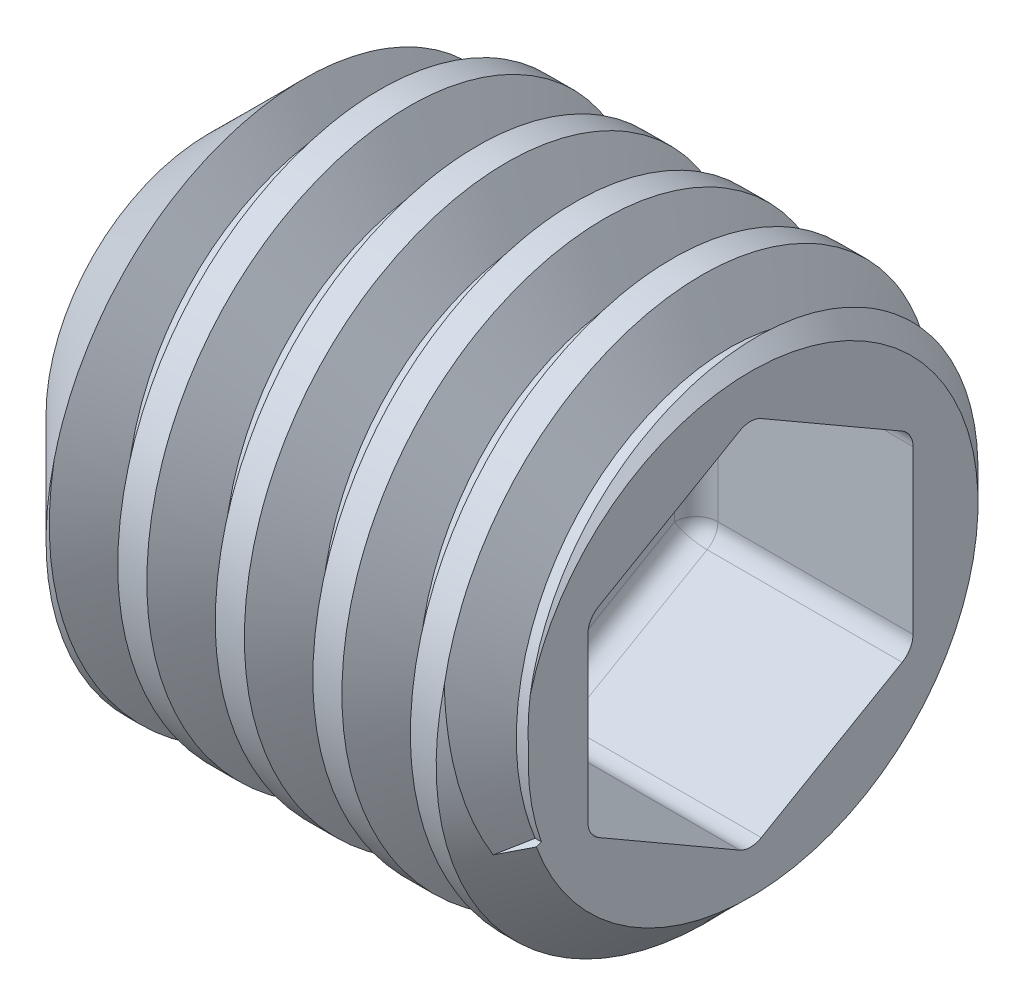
ISO-10303-21;
HEADER;
FILE_DESCRIPTION(('STEP AP214'),'2;1');
FILE_NAME('part.step','',(''),(''),'','','');
FILE_SCHEMA(('AUTOMOTIVE_DESIGN { 1 0 10303 214 1 1 1 1 }'));
ENDSEC;
DATA;
#1=APPLICATION_CONTEXT('core data for automotive mechanical design processes');
#2=APPLICATION_PROTOCOL_DEFINITION('international standard','automotive_design',2000,#1);
#3=PRODUCT_CONTEXT('',#1,'mechanical');
#4=PRODUCT('Part','Part','',(#3));
#5=PRODUCT_RELATED_PRODUCT_CATEGORY('part','',(#4));
#6=PRODUCT_DEFINITION_FORMATION('','',#4);
#7=PRODUCT_DEFINITION_CONTEXT('part definition',#1,'design');
#8=PRODUCT_DEFINITION('design','',#6,#7);
#9=PRODUCT_DEFINITION_SHAPE('','',#8);
#10=(LENGTH_UNIT() NAMED_UNIT(*) SI_UNIT(.MILLI.,.METRE.));
#11=(NAMED_UNIT(*) PLANE_ANGLE_UNIT() SI_UNIT($,.RADIAN.));
#12=(NAMED_UNIT(*) SI_UNIT($,.STERADIAN.) SOLID_ANGLE_UNIT());
#13=UNCERTAINTY_MEASURE_WITH_UNIT(LENGTH_MEASURE(1.E-05),#10,'distance_accuracy_value','');
#14=(GEOMETRIC_REPRESENTATION_CONTEXT(3) GLOBAL_UNCERTAINTY_ASSIGNED_CONTEXT((#13)) GLOBAL_UNIT_ASSIGNED_CONTEXT((#10,
#11,#12)) REPRESENTATION_CONTEXT('',''));
#15=CARTESIAN_POINT('',(0.,0.,0.));
#16=DIRECTION('',(0.,0.,1.));
#17=DIRECTION('',(1.,0.,0.));
#18=AXIS2_PLACEMENT_3D('',#15,#16,#17);
#19=CARTESIAN_POINT('',(0.,0.75,0.));
#20=DIRECTION('',(-1.,0.,0.));
#21=DIRECTION('',(0.,0.,1.));
#22=AXIS2_PLACEMENT_3D('',#19,#20,#21);
#23=PLANE('',#22);
#24=CARTESIAN_POINT('',(0.,0.,0.));
#25=DIRECTION('',(1.,0.,0.));
#26=DIRECTION('',(0.,0.,-1.));
#27=AXIS2_PLACEMENT_3D('',#24,#25,#26);
#28=CIRCLE('',#27,0.75);
#29=CARTESIAN_POINT('',(0.,0.,-0.75));
#30=VERTEX_POINT('',#29);
#31=EDGE_CURVE('E591',#30,#30,#28,.T.);
#32=ORIENTED_EDGE('',*,*,#31,.F.);
#33=EDGE_LOOP('',(#32));
#34=FACE_BOUND('',#33,.T.);
#35=ADVANCED_FACE('F56',(#34),#23,.T.);
#36=CARTESIAN_POINT('',(2.5,0.,0.));
#37=DIRECTION('',(1.,0.,0.));
#38=DIRECTION('',(0.,0.,-1.));
#39=AXIS2_PLACEMENT_3D('',#36,#37,#38);
#40=PLANE('',#39);
#41=DIRECTION('',(0.,0.338609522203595,-0.940926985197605));
#42=VECTOR('',#41,1.);
#43=CARTESIAN_POINT('',(2.5,0.,0.));
#44=LINE('',#43,#42);
#45=CARTESIAN_POINT('',(2.5,-0.355539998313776,0.987973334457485));
#46=VERTEX_POINT('',#45);
#47=CARTESIAN_POINT('',(2.5,-0.347074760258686,0.964450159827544));
#48=VERTEX_POINT('',#47);
#49=EDGE_CURVE('E229',#46,#48,#44,.T.);
#50=ORIENTED_EDGE('',*,*,#49,.F.);
#51=CARTESIAN_POINT('',(2.5,0.,0.));
#52=DIRECTION('',(1.,0.,0.));
#53=DIRECTION('',(0.,0.,-1.));
#54=AXIS2_PLACEMENT_3D('',#51,#52,#53);
#55=CIRCLE('',#54,1.05);
#56=CARTESIAN_POINT('',(2.5,0.264328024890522,1.01618438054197));
#57=VERTEX_POINT('',#56);
#58=EDGE_CURVE('E391',#46,#57,#55,.T.);
#59=ORIENTED_EDGE('',*,*,#58,.T.);
#60=CARTESIAN_POINT('',(2.5,0.0486484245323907,1.02384487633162));
#61=CARTESIAN_POINT('',(2.5,0.0789090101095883,1.02580506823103));
#62=CARTESIAN_POINT('',(2.5,0.10923796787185,1.02648898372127));
#63=CARTESIAN_POINT('',(2.5,0.169844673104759,1.02530271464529));
#64=CARTESIAN_POINT('',(2.5,0.200122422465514,1.02343262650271));
#65=CARTESIAN_POINT('',(2.5,0.290524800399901,1.01399700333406));
#66=CARTESIAN_POINT('',(2.5,0.350295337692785,1.00261102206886));
#67=CARTESIAN_POINT('',(2.5,0.467049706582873,0.969955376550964));
#68=CARTESIAN_POINT('',(2.5,0.52403318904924,0.948684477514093));
#69=CARTESIAN_POINT('',(2.5,0.633606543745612,0.896884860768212));
#70=CARTESIAN_POINT('',(2.5,0.6861974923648,0.866358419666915));
#71=CARTESIAN_POINT('',(2.5,0.785528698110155,0.796888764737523));
#72=CARTESIAN_POINT('',(2.5,0.832268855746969,0.757945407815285));
#73=CARTESIAN_POINT('',(2.5,0.896958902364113,0.694151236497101));
#74=CARTESIAN_POINT('',(2.5,0.91762201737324,0.671985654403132));
#75=CARTESIAN_POINT('',(2.5,0.956996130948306,0.625987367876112));
#76=CARTESIAN_POINT('',(2.5,0.975707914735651,0.602155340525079));
#77=CARTESIAN_POINT('',(2.5,1.00593112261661,0.560299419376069));
#78=CARTESIAN_POINT('',(2.5,1.01794081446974,0.542630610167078));
#79=CARTESIAN_POINT('',(2.5,1.04098387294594,0.506721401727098));
#80=CARTESIAN_POINT('',(2.5,1.05201932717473,0.488482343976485));
#81=CARTESIAN_POINT('',(2.49999999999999,1.06260000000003,0.469985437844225));
#82=B_SPLINE_CURVE_WITH_KNOTS('',3,(#60,#61,#62,#63,#64,#65,#66,#67,#68,#69,#70,#71,#72,#73,#74,
#75,#76,#77,#78,#79,#80,#81),.UNSPECIFIED.,.F.,.F.,(4,2,2,2,2,2,2,2,2,2,4),(0.,
0.0909166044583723,0.181829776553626,0.363428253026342,0.545049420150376,0.72662594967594,
0.908205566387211,0.999027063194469,1.08981187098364,1.15387576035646,1.2177988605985),.UNSPECIFIED.);
#83=CARTESIAN_POINT('',(2.5,0.0486484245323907,1.02384487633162));
#84=VERTEX_POINT('',#83);
#85=EDGE_CURVE('E347',#84,#57,#82,.T.);
#86=ORIENTED_EDGE('',*,*,#85,.F.);
#87=CARTESIAN_POINT('',(2.5,-0.347074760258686,0.964450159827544));
#88=CARTESIAN_POINT('',(2.49999999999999,-0.311730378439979,0.977188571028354));
#89=CARTESIAN_POINT('',(2.49999999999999,-0.275670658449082,0.987956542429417));
#90=CARTESIAN_POINT('',(2.50000000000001,-0.192450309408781,1.0079048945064));
#91=CARTESIAN_POINT('',(2.50000000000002,-0.144982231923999,1.01581872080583));
#92=CARTESIAN_POINT('',(2.49999999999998,-0.0487438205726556,1.02500740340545));
#93=CARTESIAN_POINT('',(2.49999999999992,3.54438671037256E-05,1.02618867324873));
#94=CARTESIAN_POINT('',(2.49999999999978,0.0486484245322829,1.02384487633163));
#95=B_SPLINE_CURVE_WITH_KNOTS('',3,(#87,#88,#89,#90,#91,#92,#93,#94),.UNSPECIFIED.,.F.,.F.,(4,2,
2,4),(0.,0.112670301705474,0.256558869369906,0.402442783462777),.UNSPECIFIED.);
#96=EDGE_CURVE('E280',#48,#84,#95,.T.);
#97=ORIENTED_EDGE('',*,*,#96,.F.);
#98=EDGE_LOOP('',(#50,#59,#86,#97));
#99=FACE_BOUND('',#98,.T.);
#100=DIRECTION('',(0.,0.5,0.866025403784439));
#101=VECTOR('',#100,1.);
#102=CARTESIAN_POINT('',(2.5,0.43301270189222,-0.75));
#103=LINE('',#102,#101);
#104=CARTESIAN_POINT('',(2.5,0.461880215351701,-0.7));
#105=VERTEX_POINT('',#104);
#106=CARTESIAN_POINT('',(2.5,0.837157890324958,-0.0499999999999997));
#107=VERTEX_POINT('',#106);
#108=EDGE_CURVE('E559',#105,#107,#103,.T.);
#109=ORIENTED_EDGE('',*,*,#108,.F.);
#110=CARTESIAN_POINT('',(2.5,0.375277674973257,-0.65));
#111=DIRECTION('',(1.,0.,0.));
#112=DIRECTION('',(0.,0.,-1.));
#113=AXIS2_PLACEMENT_3D('',#110,#111,#112);
#114=CIRCLE('',#113,0.1);
#115=CARTESIAN_POINT('',(2.5,0.375277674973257,-0.75));
#116=VERTEX_POINT('',#115);
#117=EDGE_CURVE('E473',#105,#116,#114,.F.);
#118=ORIENTED_EDGE('',*,*,#117,.T.);
#119=DIRECTION('',(0.,1.,0.));
#120=VECTOR('',#119,1.);
#121=CARTESIAN_POINT('',(2.5,-0.433012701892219,-0.75));
#122=LINE('',#121,#120);
#123=CARTESIAN_POINT('',(2.5,-0.375277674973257,-0.75));
#124=VERTEX_POINT('',#123);
#125=EDGE_CURVE('E588',#124,#116,#122,.T.);
#126=ORIENTED_EDGE('',*,*,#125,.F.);
#127=CARTESIAN_POINT('',(2.5,-0.375277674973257,-0.65));
#128=DIRECTION('',(1.,0.,0.));
#129=DIRECTION('',(0.,0.,-1.));
#130=AXIS2_PLACEMENT_3D('',#127,#128,#129);
#131=CIRCLE('',#130,0.1);
#132=CARTESIAN_POINT('',(2.5,-0.461880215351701,-0.7));
#133=VERTEX_POINT('',#132);
#134=EDGE_CURVE('E476',#124,#133,#131,.F.);
#135=ORIENTED_EDGE('',*,*,#134,.T.);
#136=DIRECTION('',(0.,0.5,-0.866025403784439));
#137=VECTOR('',#136,1.);
#138=CARTESIAN_POINT('',(2.5,-0.866025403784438,0.));
#139=LINE('',#138,#137);
#140=CARTESIAN_POINT('',(2.5,-0.837157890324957,-0.0499999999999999));
#141=VERTEX_POINT('',#140);
#142=EDGE_CURVE('E584',#141,#133,#139,.T.);
#143=ORIENTED_EDGE('',*,*,#142,.F.);
#144=CARTESIAN_POINT('',(2.5,-0.750555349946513,0.));
#145=DIRECTION('',(1.,0.,0.));
#146=DIRECTION('',(0.,0.,-1.));
#147=AXIS2_PLACEMENT_3D('',#144,#145,#146);
#148=CIRCLE('',#147,0.1);
#149=CARTESIAN_POINT('',(2.5,-0.837157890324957,0.0499999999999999));
#150=VERTEX_POINT('',#149);
#151=EDGE_CURVE('E488',#141,#150,#148,.F.);
#152=ORIENTED_EDGE('',*,*,#151,.T.);
#153=DIRECTION('',(0.,-0.5,-0.866025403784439));
#154=VECTOR('',#153,1.);
#155=CARTESIAN_POINT('',(2.5,-0.433012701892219,0.75));
#156=LINE('',#155,#154);
#157=CARTESIAN_POINT('',(2.5,-0.461880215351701,0.7));
#158=VERTEX_POINT('',#157);
#159=EDGE_CURVE('E580',#158,#150,#156,.T.);
#160=ORIENTED_EDGE('',*,*,#159,.F.);
#161=CARTESIAN_POINT('',(2.5,-0.375277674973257,0.65));
#162=DIRECTION('',(1.,0.,0.));
#163=DIRECTION('',(0.,0.,-1.));
#164=AXIS2_PLACEMENT_3D('',#161,#162,#163);
#165=CIRCLE('',#164,0.1);
#166=CARTESIAN_POINT('',(2.5,-0.375277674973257,0.75));
#167=VERTEX_POINT('',#166);
#168=EDGE_CURVE('E485',#158,#167,#165,.F.);
#169=ORIENTED_EDGE('',*,*,#168,.T.);
#170=DIRECTION('',(0.,-1.,0.));
#171=VECTOR('',#170,1.);
#172=CARTESIAN_POINT('',(2.5,0.433012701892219,0.75));
#173=LINE('',#172,#171);
#174=CARTESIAN_POINT('',(2.5,0.375277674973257,0.75));
#175=VERTEX_POINT('',#174);
#176=EDGE_CURVE('E571',#175,#167,#173,.T.);
#177=ORIENTED_EDGE('',*,*,#176,.F.);
#178=CARTESIAN_POINT('',(2.5,0.375277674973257,0.65));
#179=DIRECTION('',(1.,0.,0.));
#180=DIRECTION('',(0.,0.,-1.));
#181=AXIS2_PLACEMENT_3D('',#178,#179,#180);
#182=CIRCLE('',#181,0.1);
#183=CARTESIAN_POINT('',(2.5,0.461880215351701,0.7));
#184=VERTEX_POINT('',#183);
#185=EDGE_CURVE('E482',#175,#184,#182,.F.);
#186=ORIENTED_EDGE('',*,*,#185,.T.);
#187=DIRECTION('',(0.,-0.5,0.866025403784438));
#188=VECTOR('',#187,1.);
#189=CARTESIAN_POINT('',(2.5,0.866025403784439,0.));
#190=LINE('',#189,#188);
#191=CARTESIAN_POINT('',(2.5,0.837157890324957,0.0500000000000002));
#192=VERTEX_POINT('',#191);
#193=EDGE_CURVE('E565',#192,#184,#190,.T.);
#194=ORIENTED_EDGE('',*,*,#193,.F.);
#195=CARTESIAN_POINT('',(2.5,0.750555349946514,0.));
#196=DIRECTION('',(1.,0.,0.));
#197=DIRECTION('',(0.,0.,-1.));
#198=AXIS2_PLACEMENT_3D('',#195,#196,#197);
#199=CIRCLE('',#198,0.1);
#200=EDGE_CURVE('E479',#192,#107,#199,.F.);
#201=ORIENTED_EDGE('',*,*,#200,.T.);
#202=EDGE_LOOP('',(#109,#118,#126,#135,#143,#152,#160,#169,#177,#186,#194,#201));
#203=FACE_BOUND('',#202,.T.);
#204=ADVANCED_FACE('F281',(#99,#203),#40,.T.);
#205=CARTESIAN_POINT('',(2.5,0.,0.));
#206=DIRECTION('',(-1.,0.,0.));
#207=DIRECTION('',(0.,0.,1.));
#208=AXIS2_PLACEMENT_3D('',#205,#206,#207);
#209=CONICAL_SURFACE('',#208,1.05,0.785398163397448);
#210=CARTESIAN_POINT('',(2.5,0.264328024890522,1.01618438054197));
#211=CARTESIAN_POINT('',(2.49786401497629,0.312220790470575,1.00595452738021));
#212=CARTESIAN_POINT('',(2.49569445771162,0.359379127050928,0.992375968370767));
#213=CARTESIAN_POINT('',(2.49132705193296,0.451428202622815,0.958846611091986));
#214=CARTESIAN_POINT('',(2.48912917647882,0.496316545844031,0.938889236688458));
#215=CARTESIAN_POINT('',(2.48426945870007,0.592396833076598,0.88792550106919));
#216=CARTESIAN_POINT('',(2.48161129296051,0.642819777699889,0.855457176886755));
#217=CARTESIAN_POINT('',(2.47639293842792,0.737495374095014,0.782491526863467));
#218=CARTESIAN_POINT('',(2.47383273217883,0.78174912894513,0.741995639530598));
#219=CARTESIAN_POINT('',(2.47011514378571,0.842518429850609,0.676171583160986));
#220=CARTESIAN_POINT('',(2.46889620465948,0.861842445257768,0.653379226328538));
#221=CARTESIAN_POINT('',(2.4665129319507,0.898504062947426,0.606237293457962));
#222=CARTESIAN_POINT('',(2.46534859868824,0.915841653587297,0.581887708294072));
#223=CARTESIAN_POINT('',(2.46305140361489,0.94842917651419,0.531818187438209));
#224=CARTESIAN_POINT('',(2.46191855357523,0.963678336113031,0.506097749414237));
#225=CARTESIAN_POINT('',(2.45959066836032,0.992067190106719,0.453527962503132));
#226=CARTESIAN_POINT('',(2.45839562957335,1.00520676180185,0.426678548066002));
#227=CARTESIAN_POINT('',(2.45471772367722,1.04175208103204,0.343634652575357));
#228=CARTESIAN_POINT('',(2.45218363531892,1.06168610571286,0.28586354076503));
#229=CARTESIAN_POINT('',(2.44704195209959,1.09180592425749,0.167876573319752));
#230=CARTESIAN_POINT('',(2.44443436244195,1.10199240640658,0.107660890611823));
#231=CARTESIAN_POINT('',(2.43915254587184,1.11249126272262,-0.015187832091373));
#232=CARTESIAN_POINT('',(2.43647831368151,1.11254547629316,-0.0778433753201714));
#233=CARTESIAN_POINT('',(2.43120886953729,1.10212503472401,-0.202254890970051));
#234=CARTESIAN_POINT('',(2.42861364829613,1.09165162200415,-0.264010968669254));
#235=CARTESIAN_POINT('',(2.42355255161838,1.06047667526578,-0.38491166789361));
#236=CARTESIAN_POINT('',(2.42108664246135,1.03977782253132,-0.444056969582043));
#237=CARTESIAN_POINT('',(2.41758482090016,1.00150329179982,-0.529463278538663));
#238=CARTESIAN_POINT('',(2.41645005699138,0.987535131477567,-0.557388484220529));
#239=CARTESIAN_POINT('',(2.4141510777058,0.957360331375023,-0.61203566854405));
#240=CARTESIAN_POINT('',(2.4129868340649,0.941151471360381,-0.638756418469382));
#241=CARTESIAN_POINT('',(2.40940265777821,0.88899164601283,-0.717375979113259));
#242=CARTESIAN_POINT('',(2.4069134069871,0.849769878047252,-0.767150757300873));
#243=CARTESIAN_POINT('',(2.40184592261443,0.763731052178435,-0.859624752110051));
#244=CARTESIAN_POINT('',(2.39926769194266,0.71691424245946,-0.902324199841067));
#245=CARTESIAN_POINT('',(2.39534394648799,0.641197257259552,-0.960811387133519));
#246=CARTESIAN_POINT('',(2.39400547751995,0.614586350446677,-0.979625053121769));
#247=CARTESIAN_POINT('',(2.39133349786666,0.559898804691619,-1.01492759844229));
#248=CARTESIAN_POINT('',(2.38999998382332,0.531823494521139,-1.03141853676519));
#249=CARTESIAN_POINT('',(2.38601870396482,0.445651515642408,-1.07724953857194));
#250=CARTESIAN_POINT('',(2.38338867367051,0.385579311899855,-1.10297051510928));
#251=CARTESIAN_POINT('',(2.37825204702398,0.261965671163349,-1.14394061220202));
#252=CARTESIAN_POINT('',(2.37574543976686,0.198424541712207,-1.15919065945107));
#253=CARTESIAN_POINT('',(2.37212943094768,0.101916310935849,-1.17390537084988));
#254=CARTESIAN_POINT('',(2.37094750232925,0.0695303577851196,-1.17744993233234));
#255=CARTESIAN_POINT('',(2.36863645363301,0.00457255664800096,-1.18180263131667));
#256=CARTESIAN_POINT('',(2.36750733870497,-0.0279993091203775,-1.18261050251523));
#257=CARTESIAN_POINT('',(2.3640248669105,-0.125939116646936,-1.18107548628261));
#258=CARTESIAN_POINT('',(2.36158424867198,-0.191285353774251,-1.17473796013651));
#259=CARTESIAN_POINT('',(2.3566016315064,-0.320053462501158,-1.15154042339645));
#260=CARTESIAN_POINT('',(2.35405962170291,-0.383475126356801,-1.13467928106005));
#261=CARTESIAN_POINT('',(2.34883580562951,-0.508979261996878,-1.09009952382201));
#262=CARTESIAN_POINT('',(2.34615226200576,-0.570931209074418,-1.06201169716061));
#263=CARTESIAN_POINT('',(2.34081566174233,-0.689218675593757,-0.995838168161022));
#264=CARTESIAN_POINT('',(2.33816260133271,-0.745554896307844,-0.957753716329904));
#265=CARTESIAN_POINT('',(2.33296048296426,-0.85104547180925,-0.872631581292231));
#266=CARTESIAN_POINT('',(2.33041141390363,-0.900200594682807,-0.825594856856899));
#267=CARTESIAN_POINT('',(2.32670854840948,-0.96746416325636,-0.749404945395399));
#268=CARTESIAN_POINT('',(2.32549367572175,-0.988818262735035,-0.723051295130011));
#269=CARTESIAN_POINT('',(2.32312931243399,-1.02922393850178,-0.668622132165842));
#270=CARTESIAN_POINT('',(2.32197982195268,-1.04827551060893,-0.640546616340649));
#271=CARTESIAN_POINT('',(2.31967932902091,-1.08397929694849,-0.582943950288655));
#272=CARTESIAN_POINT('',(2.31852832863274,-1.10063350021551,-0.553418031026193));
#273=CARTESIAN_POINT('',(2.31617182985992,-1.1315048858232,-0.493129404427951));
#274=CARTESIAN_POINT('',(2.3149663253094,-1.14572179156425,-0.46236655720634));
#275=CARTESIAN_POINT('',(2.31130515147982,-1.18452047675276,-0.368553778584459));
#276=CARTESIAN_POINT('',(2.30880034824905,-1.20531992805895,-0.303866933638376));
#277=CARTESIAN_POINT('',(2.30522739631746,-1.22705991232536,-0.21107534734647));
#278=CARTESIAN_POINT('',(2.30418465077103,-1.23247349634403,-0.18393363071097));
#279=CARTESIAN_POINT('',(2.30209494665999,-1.24148325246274,-0.129402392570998));
#280=CARTESIAN_POINT('',(2.30104799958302,-1.24508279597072,-0.102013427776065));
#281=CARTESIAN_POINT('',(2.3,-1.24777674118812,-0.0745198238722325));
#282=B_SPLINE_CURVE_WITH_KNOTS('',3,(#210,#211,#212,#213,#214,#215,#216,#217,#218,#219,#220,
#221,#222,#223,#224,#225,#226,#227,#228,#229,#230,#231,#232,#233,#234,#235,#236,#237,#238,#239,
#240,#241,#242,#243,#244,#245,#246,#247,#248,#249,#250,#251,#252,#253,#254,#255,#256,#257,#258,
#259,#260,#261,#262,#263,#264,#265,#266,#267,#268,#269,#270,#271,#272,#273,#274,#275,#276,#277,
#278,#279,#280,#281),.UNSPECIFIED.,.F.,.F.,(4,2,2,2,2,2,2,2,2,2,2,2,2,2,2,2,2,2,2,2,2,2,2,2,2,2,
2,2,2,2,2,2,2,2,2,4),(0.,0.146912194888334,0.293976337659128,0.47321004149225,0.652411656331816,
0.742042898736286,0.831674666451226,0.921339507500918,1.0110095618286,1.19360333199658,
1.37618420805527,1.5634164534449,1.75062660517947,1.93778769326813,2.03142798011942,
2.12516172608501,2.31452110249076,2.50387429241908,2.60162339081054,2.69928528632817,
2.89449873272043,3.08969490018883,3.18739445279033,3.28510351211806,3.48125883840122,
3.67743526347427,3.88067800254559,4.08389532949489,4.28709090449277,4.38881340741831,
4.49053609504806,4.59217389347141,4.69382321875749,4.89672854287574,4.97977199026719,
5.06266052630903),.UNSPECIFIED.);
#283=CARTESIAN_POINT('',(2.29999999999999,-1.24777674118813,-0.0745198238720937));
#284=VERTEX_POINT('',#283);
#285=EDGE_CURVE('E339',#57,#284,#282,.T.);
#286=ORIENTED_EDGE('',*,*,#285,.F.);
#287=ORIENTED_EDGE('',*,*,#58,.F.);
#288=DIRECTION('',(-0.707106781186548,-0.239433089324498,0.665335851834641));
#289=VECTOR('',#288,1.);
#290=CARTESIAN_POINT('',(3.55,0.,0.));
#291=LINE('',#290,#289);
#292=CARTESIAN_POINT('',(2.39743236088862,-0.390270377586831,1.08448199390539));
#293=VERTEX_POINT('',#292);
#294=EDGE_CURVE('E607',#293,#46,#291,.F.);
#295=ORIENTED_EDGE('',*,*,#294,.F.);
#296=CARTESIAN_POINT('',(2.3,0.304823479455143,1.21226343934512));
#297=CARTESIAN_POINT('',(2.30250386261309,0.286428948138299,1.21430717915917));
#298=CARTESIAN_POINT('',(2.30499980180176,0.267989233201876,1.21595389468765));
#299=CARTESIAN_POINT('',(2.30997044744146,0.231055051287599,1.21845109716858));
#300=CARTESIAN_POINT('',(2.31244515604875,0.212560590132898,1.21930166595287));
#301=CARTESIAN_POINT('',(2.31737309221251,0.175513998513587,1.22020566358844));
#302=CARTESIAN_POINT('',(2.31982627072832,0.156961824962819,1.22025759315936));
#303=CARTESIAN_POINT('',(2.32469980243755,0.119867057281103,1.21956165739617));
#304=CARTESIAN_POINT('',(2.32712015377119,0.101324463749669,1.21881374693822));
#305=CARTESIAN_POINT('',(2.33185930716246,0.0648033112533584,1.21654723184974));
#306=CARTESIAN_POINT('',(2.33417905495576,0.0468234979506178,1.21505079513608));
#307=CARTESIAN_POINT('',(2.33876475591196,0.0109356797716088,1.21131801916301));
#308=CARTESIAN_POINT('',(2.34103071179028,-0.00697232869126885,1.20908171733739));
#309=CARTESIAN_POINT('',(2.3479333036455,-0.0604578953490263,1.20107715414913));
#310=CARTESIAN_POINT('',(2.35267977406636,-0.0958399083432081,1.19401101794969));
#311=CARTESIAN_POINT('',(2.36065895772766,-0.153157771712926,1.17966029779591));
#312=CARTESIAN_POINT('',(2.36382312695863,-0.175359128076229,1.17336553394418));
#313=CARTESIAN_POINT('',(2.37024407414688,-0.219318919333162,1.15941547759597));
#314=CARTESIAN_POINT('',(2.37350085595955,-0.241077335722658,1.15176012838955));
#315=CARTESIAN_POINT('',(2.38351427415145,-0.306330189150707,1.12650308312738));
#316=CARTESIAN_POINT('',(2.39040333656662,-0.349004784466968,1.10680966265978));
#317=CARTESIAN_POINT('',(2.39743236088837,-0.390270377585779,1.08448199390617));
#318=B_SPLINE_CURVE_WITH_KNOTS('',3,(#296,#297,#298,#299,#300,#301,#302,#303,#304,#305,#306,
#307,#308,#309,#310,#311,#312,#313,#314,#315,#316,#317),.UNSPECIFIED.,.F.,.F.,(4,2,2,2,2,2,2,2,
2,2,4),(0.,0.0560246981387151,0.112043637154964,0.168167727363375,0.224294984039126,
0.278850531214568,0.33340331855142,0.44237958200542,0.512218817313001,0.582060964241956,
0.724215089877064),.UNSPECIFIED.);
#319=CARTESIAN_POINT('',(2.3,0.304823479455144,1.21226343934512));
#320=VERTEX_POINT('',#319);
#321=EDGE_CURVE('E209',#320,#293,#318,.T.);
#322=ORIENTED_EDGE('',*,*,#321,.F.);
#323=CARTESIAN_POINT('',(2.3,0.,0.));
#324=DIRECTION('',(1.,0.,0.));
#325=DIRECTION('',(0.,0.,-1.));
#326=AXIS2_PLACEMENT_3D('',#323,#324,#325);
#327=CIRCLE('',#326,1.25);
#328=EDGE_CURVE('E388',#320,#284,#327,.T.);
#329=ORIENTED_EDGE('',*,*,#328,.T.);
#330=EDGE_LOOP('',(#286,#287,#295,#322,#329));
#331=FACE_BOUND('',#330,.T.);
#332=ADVANCED_FACE('F353',(#331),#209,.T.);
#333=CARTESIAN_POINT('',(0.,0.,0.));
#334=DIRECTION('',(1.,0.,0.));
#335=DIRECTION('',(0.,0.,-1.));
#336=AXIS2_PLACEMENT_3D('',#333,#334,#335);
#337=CYLINDRICAL_SURFACE('',#336,1.25);
#338=CARTESIAN_POINT('',(0.158028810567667,0.,-1.25));
#339=CARTESIAN_POINT('',(0.195528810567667,0.721687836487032,-1.25));
#340=CARTESIAN_POINT('',(0.233028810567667,1.08253175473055,-0.625));
#341=CARTESIAN_POINT('',(0.270528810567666,1.44337567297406,0.));
#342=CARTESIAN_POINT('',(0.308028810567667,1.08253175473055,0.625));
#343=CARTESIAN_POINT('',(0.345528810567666,0.721687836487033,1.25));
#344=CARTESIAN_POINT('',(0.383028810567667,0.,1.25));
#345=CARTESIAN_POINT('',(0.420528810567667,-0.721687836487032,1.25));
#346=CARTESIAN_POINT('',(0.458028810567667,-1.08253175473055,0.625000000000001));
#347=CARTESIAN_POINT('',(0.495528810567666,-1.44337567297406,0.));
#348=CARTESIAN_POINT('',(0.533028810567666,-1.08253175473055,-0.624999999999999));
#349=CARTESIAN_POINT('',(0.570528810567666,-0.721687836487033,-1.25));
#350=CARTESIAN_POINT('',(0.608028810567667,0.,-1.25));
#351=CARTESIAN_POINT('',(0.645528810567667,0.721687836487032,-1.25));
#352=CARTESIAN_POINT('',(0.683028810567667,1.08253175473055,-0.625));
#353=CARTESIAN_POINT('',(0.720528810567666,1.44337567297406,0.));
#354=CARTESIAN_POINT('',(0.758028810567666,1.08253175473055,0.625));
#355=CARTESIAN_POINT('',(0.795528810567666,0.721687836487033,1.25));
#356=CARTESIAN_POINT('',(0.833028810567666,0.,1.25));
#357=CARTESIAN_POINT('',(0.870528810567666,-0.721687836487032,1.25));
#358=CARTESIAN_POINT('',(0.908028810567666,-1.08253175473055,0.625000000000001));
#359=CARTESIAN_POINT('',(0.945528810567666,-1.44337567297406,0.));
#360=CARTESIAN_POINT('',(0.983028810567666,-1.08253175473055,-0.624999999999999));
#361=CARTESIAN_POINT('',(1.02052881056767,-0.721687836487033,-1.25));
#362=CARTESIAN_POINT('',(1.05802881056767,0.,-1.25));
#363=CARTESIAN_POINT('',(1.09552881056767,0.721687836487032,-1.25));
#364=CARTESIAN_POINT('',(1.13302881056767,1.08253175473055,-0.625));
#365=CARTESIAN_POINT('',(1.17052881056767,1.44337567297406,0.));
#366=CARTESIAN_POINT('',(1.20802881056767,1.08253175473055,0.625));
#367=CARTESIAN_POINT('',(1.24552881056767,0.721687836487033,1.25));
#368=CARTESIAN_POINT('',(1.28302881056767,0.,1.25));
#369=CARTESIAN_POINT('',(1.32052881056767,-0.721687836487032,1.25));
#370=CARTESIAN_POINT('',(1.35802881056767,-1.08253175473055,0.625000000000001));
#371=CARTESIAN_POINT('',(1.39552881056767,-1.44337567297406,0.));
#372=CARTESIAN_POINT('',(1.43302881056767,-1.08253175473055,-0.624999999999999));
#373=CARTESIAN_POINT('',(1.47052881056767,-0.721687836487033,-1.25));
#374=CARTESIAN_POINT('',(1.50802881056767,0.,-1.25));
#375=CARTESIAN_POINT('',(1.54552881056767,0.721687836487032,-1.25));
#376=CARTESIAN_POINT('',(1.58302881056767,1.08253175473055,-0.625));
#377=CARTESIAN_POINT('',(1.62052881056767,1.44337567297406,0.));
#378=CARTESIAN_POINT('',(1.65802881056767,1.08253175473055,0.625));
#379=CARTESIAN_POINT('',(1.69552881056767,0.721687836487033,1.25));
#380=CARTESIAN_POINT('',(1.73302881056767,0.,1.25));
#381=CARTESIAN_POINT('',(1.77052881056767,-0.721687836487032,1.25));
#382=CARTESIAN_POINT('',(1.80802881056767,-1.08253175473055,0.625000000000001));
#383=CARTESIAN_POINT('',(1.84552881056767,-1.44337567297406,0.));
#384=CARTESIAN_POINT('',(1.88302881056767,-1.08253175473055,-0.624999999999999));
#385=CARTESIAN_POINT('',(1.92052881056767,-0.721687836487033,-1.25));
#386=CARTESIAN_POINT('',(1.95802881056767,0.,-1.25));
#387=CARTESIAN_POINT('',(1.99552881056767,0.721687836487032,-1.25));
#388=CARTESIAN_POINT('',(2.03302881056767,1.08253175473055,-0.625));
#389=CARTESIAN_POINT('',(2.07052881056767,1.44337567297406,0.));
#390=CARTESIAN_POINT('',(2.10802881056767,1.08253175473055,0.625));
#391=CARTESIAN_POINT('',(2.14552881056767,0.721687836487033,1.25));
#392=CARTESIAN_POINT('',(2.18302881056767,0.,1.25));
#393=CARTESIAN_POINT('',(2.22052881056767,-0.721687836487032,1.25));
#394=CARTESIAN_POINT('',(2.25802881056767,-1.08253175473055,0.625000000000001));
#395=CARTESIAN_POINT('',(2.29552881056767,-1.44337567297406,0.));
#396=CARTESIAN_POINT('',(2.33302881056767,-1.08253175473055,-0.624999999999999));
#397=CARTESIAN_POINT('',(2.37052881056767,-0.721687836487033,-1.25));
#398=CARTESIAN_POINT('',(2.40802881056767,0.,-1.25));
#399=CARTESIAN_POINT('',(2.44552881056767,0.721687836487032,-1.25));
#400=CARTESIAN_POINT('',(2.48302881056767,1.08253175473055,-0.625));
#401=CARTESIAN_POINT('',(2.52052881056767,1.44337567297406,0.));
#402=CARTESIAN_POINT('',(2.55802881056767,1.08253175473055,0.625));
#403=CARTESIAN_POINT('',(2.59552881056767,0.721687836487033,1.25));
#404=CARTESIAN_POINT('',(2.63302881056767,0.,1.25));
#405=CARTESIAN_POINT('',(2.64436016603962,-0.218072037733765,1.25));
#406=CARTESIAN_POINT('',(2.65723738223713,-0.423261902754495,1.17615873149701));
#407=(BOUNDED_CURVE() B_SPLINE_CURVE(2,(#338,#339,#340,#341,#342,#343,#344,#345,#346,#347,#348,
#349,#350,#351,#352,#353,#354,#355,#356,#357,#358,#359,#360,#361,#362,#363,#364,#365,#366,#367,
#368,#369,#370,#371,#372,#373,#374,#375,#376,#377,#378,#379,#380,#381,#382,#383,#384,#385,#386,
#387,#388,#389,#390,#391,#392,#393,#394,#395,#396,#397,#398,#399,#400,#401,#402,#403,#404,#405,
#406),.UNSPECIFIED.,.F.,.F.) B_SPLINE_CURVE_WITH_KNOTS((3,2,2,2,2,2,2,2,2,2,2,2,2,2,2,2,2,2,2,2,
2,2,2,2,2,2,2,2,2,2,2,2,2,2,3),(0.,0.0277777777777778,0.0555555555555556,0.0833333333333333,
0.111111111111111,0.138888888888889,0.166666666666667,0.194444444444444,0.222222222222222,0.25,
0.277777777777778,0.305555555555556,0.333333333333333,0.361111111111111,0.388888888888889,
0.416666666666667,0.444444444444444,0.472222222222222,0.5,0.527777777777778,0.555555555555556,
0.583333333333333,0.611111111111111,0.638888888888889,0.666666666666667,0.694444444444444,
0.722222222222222,0.75,0.777777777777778,0.805555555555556,0.833333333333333,0.861111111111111,
0.888888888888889,0.916666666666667,0.925925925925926),
.UNSPECIFIED.) CURVE() GEOMETRIC_REPRESENTATION_ITEM() RATIONAL_B_SPLINE_CURVE((1.,
0.866025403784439,1.,0.866025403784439,1.,0.866025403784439,1.,0.866025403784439,1.,
0.866025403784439,1.,0.866025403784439,1.,0.866025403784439,1.,0.866025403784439,1.,
0.866025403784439,1.,0.866025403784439,1.,0.866025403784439,1.,0.866025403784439,1.,
0.866025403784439,1.,0.866025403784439,1.,0.866025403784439,1.,0.866025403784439,1.,
0.866025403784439,1.,0.866025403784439,1.,0.866025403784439,1.,0.866025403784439,1.,
0.866025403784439,1.,0.866025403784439,1.,0.866025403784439,1.,0.866025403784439,1.,
0.866025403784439,1.,0.866025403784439,1.,0.866025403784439,1.,0.866025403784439,1.,
0.866025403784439,1.,0.866025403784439,1.,0.866025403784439,1.,0.866025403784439,1.,
0.866025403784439,1.,0.955341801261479,0.940455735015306)) REPRESENTATION_ITEM(''));
#408=CARTESIAN_POINT('',(0.500000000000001,-1.24777674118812,-0.0745198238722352));
#409=VERTEX_POINT('',#408);
#410=EDGE_CURVE('E328',#409,#284,#407,.T.);
#411=ORIENTED_EDGE('',*,*,#410,.T.);
#412=ORIENTED_EDGE('',*,*,#328,.F.);
#413=CARTESIAN_POINT('',(-0.158028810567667,0.,-1.25));
#414=CARTESIAN_POINT('',(-0.120528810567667,0.721687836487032,-1.25));
#415=CARTESIAN_POINT('',(-0.0830288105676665,1.08253175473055,-0.625));
#416=CARTESIAN_POINT('',(-0.0455288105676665,1.44337567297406,0.));
#417=CARTESIAN_POINT('',(-0.00802881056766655,1.08253175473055,0.625));
#418=CARTESIAN_POINT('',(0.0294711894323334,0.721687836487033,1.25));
#419=CARTESIAN_POINT('',(0.0669711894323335,0.,1.25));
#420=CARTESIAN_POINT('',(0.104471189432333,-0.721687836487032,1.25));
#421=CARTESIAN_POINT('',(0.141971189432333,-1.08253175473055,0.625000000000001));
#422=CARTESIAN_POINT('',(0.179471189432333,-1.44337567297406,0.));
#423=CARTESIAN_POINT('',(0.216971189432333,-1.08253175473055,-0.624999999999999));
#424=CARTESIAN_POINT('',(0.254471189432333,-0.721687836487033,-1.25));
#425=CARTESIAN_POINT('',(0.291971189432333,0.,-1.25));
#426=CARTESIAN_POINT('',(0.329471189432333,0.721687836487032,-1.25));
#427=CARTESIAN_POINT('',(0.366971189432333,1.08253175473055,-0.625));
#428=CARTESIAN_POINT('',(0.404471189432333,1.44337567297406,0.));
#429=CARTESIAN_POINT('',(0.441971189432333,1.08253175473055,0.625));
#430=CARTESIAN_POINT('',(0.479471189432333,0.721687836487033,1.25));
#431=CARTESIAN_POINT('',(0.516971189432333,0.,1.25));
#432=CARTESIAN_POINT('',(0.554471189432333,-0.721687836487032,1.25));
#433=CARTESIAN_POINT('',(0.591971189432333,-1.08253175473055,0.625000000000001));
#434=CARTESIAN_POINT('',(0.629471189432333,-1.44337567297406,0.));
#435=CARTESIAN_POINT('',(0.666971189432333,-1.08253175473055,-0.624999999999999));
#436=CARTESIAN_POINT('',(0.704471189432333,-0.721687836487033,-1.25));
#437=CARTESIAN_POINT('',(0.741971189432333,0.,-1.25));
#438=CARTESIAN_POINT('',(0.779471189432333,0.721687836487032,-1.25));
#439=CARTESIAN_POINT('',(0.816971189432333,1.08253175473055,-0.625));
#440=CARTESIAN_POINT('',(0.854471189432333,1.44337567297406,0.));
#441=CARTESIAN_POINT('',(0.891971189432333,1.08253175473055,0.625));
#442=CARTESIAN_POINT('',(0.929471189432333,0.721687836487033,1.25));
#443=CARTESIAN_POINT('',(0.966971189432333,0.,1.25));
#444=CARTESIAN_POINT('',(1.00447118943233,-0.721687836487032,1.25));
#445=CARTESIAN_POINT('',(1.04197118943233,-1.08253175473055,0.625000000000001));
#446=CARTESIAN_POINT('',(1.07947118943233,-1.44337567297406,0.));
#447=CARTESIAN_POINT('',(1.11697118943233,-1.08253175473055,-0.624999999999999));
#448=CARTESIAN_POINT('',(1.15447118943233,-0.721687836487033,-1.25));
#449=CARTESIAN_POINT('',(1.19197118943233,0.,-1.25));
#450=CARTESIAN_POINT('',(1.22947118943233,0.721687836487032,-1.25));
#451=CARTESIAN_POINT('',(1.26697118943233,1.08253175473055,-0.625));
#452=CARTESIAN_POINT('',(1.30447118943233,1.44337567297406,0.));
#453=CARTESIAN_POINT('',(1.34197118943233,1.08253175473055,0.625));
#454=CARTESIAN_POINT('',(1.37947118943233,0.721687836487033,1.25));
#455=CARTESIAN_POINT('',(1.41697118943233,0.,1.25));
#456=CARTESIAN_POINT('',(1.45447118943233,-0.721687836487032,1.25));
#457=CARTESIAN_POINT('',(1.49197118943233,-1.08253175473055,0.625000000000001));
#458=CARTESIAN_POINT('',(1.52947118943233,-1.44337567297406,0.));
#459=CARTESIAN_POINT('',(1.56697118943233,-1.08253175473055,-0.624999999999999));
#460=CARTESIAN_POINT('',(1.60447118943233,-0.721687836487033,-1.25));
#461=CARTESIAN_POINT('',(1.64197118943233,0.,-1.25));
#462=CARTESIAN_POINT('',(1.67947118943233,0.721687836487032,-1.25));
#463=CARTESIAN_POINT('',(1.71697118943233,1.08253175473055,-0.625));
#464=CARTESIAN_POINT('',(1.75447118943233,1.44337567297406,0.));
#465=CARTESIAN_POINT('',(1.79197118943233,1.08253175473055,0.625));
#466=CARTESIAN_POINT('',(1.82947118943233,0.721687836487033,1.25));
#467=CARTESIAN_POINT('',(1.86697118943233,0.,1.25));
#468=CARTESIAN_POINT('',(1.90447118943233,-0.721687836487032,1.25));
#469=CARTESIAN_POINT('',(1.94197118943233,-1.08253175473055,0.625000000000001));
#470=CARTESIAN_POINT('',(1.97947118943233,-1.44337567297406,0.));
#471=CARTESIAN_POINT('',(2.01697118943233,-1.08253175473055,-0.624999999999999));
#472=CARTESIAN_POINT('',(2.05447118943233,-0.721687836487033,-1.25));
#473=CARTESIAN_POINT('',(2.09197118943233,0.,-1.25));
#474=CARTESIAN_POINT('',(2.12947118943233,0.721687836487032,-1.25));
#475=CARTESIAN_POINT('',(2.16697118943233,1.08253175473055,-0.625));
#476=CARTESIAN_POINT('',(2.20447118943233,1.44337567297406,0.));
#477=CARTESIAN_POINT('',(2.24197118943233,1.08253175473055,0.625));
#478=CARTESIAN_POINT('',(2.27947118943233,0.721687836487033,1.25));
#479=CARTESIAN_POINT('',(2.31697118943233,0.,1.25));
#480=CARTESIAN_POINT('',(2.32830254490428,-0.218072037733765,1.25));
#481=CARTESIAN_POINT('',(2.34117976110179,-0.423261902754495,1.17615873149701));
#482=(BOUNDED_CURVE() B_SPLINE_CURVE(2,(#413,#414,#415,#416,#417,#418,#419,#420,#421,#422,#423,
#424,#425,#426,#427,#428,#429,#430,#431,#432,#433,#434,#435,#436,#437,#438,#439,#440,#441,#442,
#443,#444,#445,#446,#447,#448,#449,#450,#451,#452,#453,#454,#455,#456,#457,#458,#459,#460,#461,
#462,#463,#464,#465,#466,#467,#468,#469,#470,#471,#472,#473,#474,#475,#476,#477,#478,#479,#480,
#481),.UNSPECIFIED.,.F.,.F.) B_SPLINE_CURVE_WITH_KNOTS((3,2,2,2,2,2,2,2,2,2,2,2,2,2,2,2,2,2,2,2,
2,2,2,2,2,2,2,2,2,2,2,2,2,2,3),(0.,0.0277777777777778,0.0555555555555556,0.0833333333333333,
0.111111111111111,0.138888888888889,0.166666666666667,0.194444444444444,0.222222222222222,0.25,
0.277777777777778,0.305555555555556,0.333333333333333,0.361111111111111,0.388888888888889,
0.416666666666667,0.444444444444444,0.472222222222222,0.5,0.527777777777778,0.555555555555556,
0.583333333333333,0.611111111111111,0.638888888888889,0.666666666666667,0.694444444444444,
0.722222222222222,0.75,0.777777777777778,0.805555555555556,0.833333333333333,0.861111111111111,
0.888888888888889,0.916666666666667,0.925925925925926),
.UNSPECIFIED.) CURVE() GEOMETRIC_REPRESENTATION_ITEM() RATIONAL_B_SPLINE_CURVE((1.,
0.866025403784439,1.,0.866025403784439,1.,0.866025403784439,1.,0.866025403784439,1.,
0.866025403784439,1.,0.866025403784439,1.,0.866025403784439,1.,0.866025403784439,1.,
0.866025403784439,1.,0.866025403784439,1.,0.866025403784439,1.,0.866025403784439,1.,
0.866025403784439,1.,0.866025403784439,1.,0.866025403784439,1.,0.866025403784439,1.,
0.866025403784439,1.,0.866025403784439,1.,0.866025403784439,1.,0.866025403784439,1.,
0.866025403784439,1.,0.866025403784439,1.,0.866025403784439,1.,0.866025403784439,1.,
0.866025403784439,1.,0.866025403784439,1.,0.866025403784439,1.,0.866025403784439,1.,
0.866025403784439,1.,0.866025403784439,1.,0.866025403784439,1.,0.866025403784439,1.,
0.866025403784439,1.,0.955341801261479,0.940455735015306)) REPRESENTATION_ITEM(''));
#483=CARTESIAN_POINT('',(0.500000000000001,0.304823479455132,1.21226343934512));
#484=VERTEX_POINT('',#483);
#485=EDGE_CURVE('E215',#484,#320,#482,.T.);
#486=ORIENTED_EDGE('',*,*,#485,.F.);
#487=CARTESIAN_POINT('',(0.5,0.,0.));
#488=DIRECTION('',(1.,0.,0.));
#489=DIRECTION('',(0.,0.,-1.));
#490=AXIS2_PLACEMENT_3D('',#487,#488,#489);
#491=CIRCLE('',#490,1.25);
#492=EDGE_CURVE('E392',#484,#409,#491,.T.);
#493=ORIENTED_EDGE('',*,*,#492,.T.);
#494=EDGE_LOOP('',(#411,#412,#486,#493));
#495=FACE_BOUND('',#494,.T.);
#496=ADVANCED_FACE('F357',(#495),#337,.T.);
#497=CARTESIAN_POINT('',(0.5,0.,0.));
#498=DIRECTION('',(1.,0.,0.));
#499=DIRECTION('',(0.,0.,-1.));
#500=AXIS2_PLACEMENT_3D('',#497,#498,#499);
#501=CONICAL_SURFACE('',#500,1.25,0.785398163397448);
#502=CARTESIAN_POINT('',(0.5,-1.24777674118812,-0.0745198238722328));
#503=CARTESIAN_POINT('',(0.495120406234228,-1.24495644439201,-0.0398550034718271));
#504=CARTESIAN_POINT('',(0.490204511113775,-1.24066860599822,-0.00533811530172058));
#505=CARTESIAN_POINT('',(0.480325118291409,-1.22918328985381,0.0632022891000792));
#506=CARTESIAN_POINT('',(0.475361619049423,-1.22198571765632,0.097225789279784));
#507=CARTESIAN_POINT('',(0.46039667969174,-1.19599575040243,0.198534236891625));
#508=CARTESIAN_POINT('',(0.450361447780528,-1.17282968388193,0.264767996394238));
#509=CARTESIAN_POINT('',(0.435503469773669,-1.12994325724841,0.360346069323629));
#510=CARTESIAN_POINT('',(0.430582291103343,-1.11428748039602,0.391582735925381));
#511=CARTESIAN_POINT('',(0.420841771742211,-1.08036561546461,0.45262868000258));
#512=CARTESIAN_POINT('',(0.416022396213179,-1.06210043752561,0.48243845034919));
#513=CARTESIAN_POINT('',(0.408901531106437,-1.03286080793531,0.525880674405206));
#514=CARTESIAN_POINT('',(0.406547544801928,-1.02281492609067,0.540139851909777));
#515=CARTESIAN_POINT('',(0.401891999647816,-1.00213288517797,0.568228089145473));
#516=CARTESIAN_POINT('',(0.399590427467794,-0.991496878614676,0.582057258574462));
#517=CARTESIAN_POINT('',(0.392572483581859,-0.958593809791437,0.622706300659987));
#518=CARTESIAN_POINT('',(0.387740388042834,-0.935320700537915,0.648704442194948));
#519=CARTESIAN_POINT('',(0.378033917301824,-0.887355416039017,0.697247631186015));
#520=CARTESIAN_POINT('',(0.373169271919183,-0.862759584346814,0.719890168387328));
#521=CARTESIAN_POINT('',(0.363234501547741,-0.811559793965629,0.762727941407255));
#522=CARTESIAN_POINT('',(0.358164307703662,-0.784955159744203,0.782922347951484));
#523=CARTESIAN_POINT('',(0.34269062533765,-0.70246575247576,0.839548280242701));
#524=CARTESIAN_POINT('',(0.332013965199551,-0.643855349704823,0.872073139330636));
#525=CARTESIAN_POINT('',(0.313564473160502,-0.54025658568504,0.917277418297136));
#526=CARTESIAN_POINT('',(0.305893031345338,-0.496528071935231,0.932983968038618));
#527=CARTESIAN_POINT('',(0.290477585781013,-0.407467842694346,0.958460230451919));
#528=CARTESIAN_POINT('',(0.282733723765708,-0.36213891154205,0.968239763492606));
#529=CARTESIAN_POINT('',(0.274999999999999,-0.316322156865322,0.974969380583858));
#530=B_SPLINE_CURVE_WITH_KNOTS('',3,(#502,#503,#504,#505,#506,#507,#508,#509,#510,#511,#512,
#513,#514,#515,#516,#517,#518,#519,#520,#521,#522,#523,#524,#525,#526,#527,#528,#529),
.UNSPECIFIED.,.F.,.F.,(4,2,2,2,2,2,2,2,2,2,2,2,2,4),(0.,0.10528269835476,0.210568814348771,
0.422009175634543,0.527773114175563,0.633500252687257,0.686290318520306,0.739066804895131,
0.844559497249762,0.945757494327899,1.04698967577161,1.24924148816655,1.39015226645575,
1.53082892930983),.UNSPECIFIED.);
#531=CARTESIAN_POINT('',(0.274999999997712,-0.316322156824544,0.974969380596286));
#532=VERTEX_POINT('',#531);
#533=EDGE_CURVE('E12',#409,#532,#530,.T.);
#534=ORIENTED_EDGE('',*,*,#533,.F.);
#535=ORIENTED_EDGE('',*,*,#492,.F.);
#536=CARTESIAN_POINT('',(0.275,-0.910999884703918,0.46979166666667));
#537=CARTESIAN_POINT('',(0.27701860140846,-0.935253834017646,0.427208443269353));
#538=CARTESIAN_POINT('',(0.279105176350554,-0.956470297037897,0.382920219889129));
#539=CARTESIAN_POINT('',(0.283371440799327,-0.992525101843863,0.291784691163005));
#540=CARTESIAN_POINT('',(0.285551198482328,-1.00735868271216,0.244935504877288));
#541=CARTESIAN_POINT('',(0.290398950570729,-1.03260461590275,0.140051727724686));
#542=CARTESIAN_POINT('',(0.293077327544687,-1.04153737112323,0.0816554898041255));
#543=CARTESIAN_POINT('',(0.298423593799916,-1.0494608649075,-0.0358026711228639));
#544=CARTESIAN_POINT('',(0.301091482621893,-1.0484511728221,-0.09486462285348));
#545=CARTESIAN_POINT('',(0.306340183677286,-1.03652303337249,-0.211975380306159));
#546=CARTESIAN_POINT('',(0.308920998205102,-1.02560484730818,-0.270024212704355));
#547=CARTESIAN_POINT('',(0.313940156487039,-0.994159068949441,-0.383499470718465));
#548=CARTESIAN_POINT('',(0.316378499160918,-0.973631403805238,-0.43892587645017));
#549=CARTESIAN_POINT('',(0.319846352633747,-0.936105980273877,-0.518789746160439));
#550=CARTESIAN_POINT('',(0.320970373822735,-0.922480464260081,-0.544857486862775));
#551=CARTESIAN_POINT('',(0.323269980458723,-0.893182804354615,-0.595814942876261));
#552=CARTESIAN_POINT('',(0.324445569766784,-0.877510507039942,-0.620704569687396));
#553=CARTESIAN_POINT('',(0.328027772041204,-0.82755336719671,-0.693355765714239));
#554=CARTESIAN_POINT('',(0.330491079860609,-0.790313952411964,-0.73912993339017));
#555=CARTESIAN_POINT('',(0.335600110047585,-0.707359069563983,-0.825776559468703));
#556=CARTESIAN_POINT('',(0.338249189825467,-0.661364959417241,-0.866380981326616));
#557=CARTESIAN_POINT('',(0.343560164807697,-0.563241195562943,-0.939340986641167));
#558=CARTESIAN_POINT('',(0.346222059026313,-0.511112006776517,-0.971697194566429));
#559=CARTESIAN_POINT('',(0.351500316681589,-0.401834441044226,-1.02743076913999));
#560=CARTESIAN_POINT('',(0.354116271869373,-0.344655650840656,-1.05074842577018));
#561=CARTESIAN_POINT('',(0.359222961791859,-0.227160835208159,-1.08745092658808));
#562=CARTESIAN_POINT('',(0.36171370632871,-0.166845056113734,-1.10083654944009));
#563=CARTESIAN_POINT('',(0.365283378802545,-0.0754169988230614,-1.11315609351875));
#564=CARTESIAN_POINT('',(0.36644541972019,-0.0447850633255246,-1.11596956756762));
#565=CARTESIAN_POINT('',(0.368742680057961,0.016608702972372,-1.11904093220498));
#566=CARTESIAN_POINT('',(0.369877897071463,0.0473705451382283,-1.11929859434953));
#567=CARTESIAN_POINT('',(0.373368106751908,0.13954016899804,-1.1163565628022));
#568=CARTESIAN_POINT('',(0.375808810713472,0.200865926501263,-1.10944621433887));
#569=CARTESIAN_POINT('',(0.380856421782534,0.323432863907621,-1.08546893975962));
#570=CARTESIAN_POINT('',(0.383466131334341,0.384613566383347,-1.06809651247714));
#571=CARTESIAN_POINT('',(0.388724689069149,0.503246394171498,-1.02344737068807));
#572=CARTESIAN_POINT('',(0.391373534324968,0.560698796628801,-0.996171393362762));
#573=CARTESIAN_POINT('',(0.396667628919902,0.670999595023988,-0.932053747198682));
#574=CARTESIAN_POINT('',(0.399312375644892,0.723777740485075,-0.895091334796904));
#575=CARTESIAN_POINT('',(0.40448863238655,0.822386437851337,-0.812794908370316));
#576=CARTESIAN_POINT('',(0.407020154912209,0.868217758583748,-0.767461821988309));
#577=CARTESIAN_POINT('',(0.410691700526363,0.930727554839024,-0.694250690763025));
#578=CARTESIAN_POINT('',(0.411894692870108,0.950526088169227,-0.668975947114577));
#579=CARTESIAN_POINT('',(0.414230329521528,0.987916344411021,-0.616830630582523));
#580=CARTESIAN_POINT('',(0.415362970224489,1.00550795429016,-0.589959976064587));
#581=CARTESIAN_POINT('',(0.41766218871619,1.0384487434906,-0.534872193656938));
#582=CARTESIAN_POINT('',(0.418828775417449,1.05379732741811,-0.506654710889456));
#583=CARTESIAN_POINT('',(0.42120558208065,1.0821636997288,-0.449081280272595));
#584=CARTESIAN_POINT('',(0.422415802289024,1.09518147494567,-0.419725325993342));
#585=CARTESIAN_POINT('',(0.426147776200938,1.1311284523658,-0.328878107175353));
#586=CARTESIAN_POINT('',(0.428720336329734,1.15022556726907,-0.265818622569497));
#587=CARTESIAN_POINT('',(0.433922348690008,1.17774624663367,-0.137452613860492));
#588=CARTESIAN_POINT('',(0.436551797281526,1.18617049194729,-0.0721462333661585));
#589=CARTESIAN_POINT('',(0.441845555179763,1.19219726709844,0.0602169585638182));
#590=CARTESIAN_POINT('',(0.444509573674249,1.1895904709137,0.127283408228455));
#591=CARTESIAN_POINT('',(0.449749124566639,1.1731294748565,0.260052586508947));
#592=CARTESIAN_POINT('',(0.452324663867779,1.15927615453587,0.32575542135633));
#593=CARTESIAN_POINT('',(0.456067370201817,1.13040276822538,0.421792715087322));
#594=CARTESIAN_POINT('',(0.457295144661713,1.11942546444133,0.45339360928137));
#595=CARTESIAN_POINT('',(0.45970273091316,1.09484468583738,0.515567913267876));
#596=CARTESIAN_POINT('',(0.460882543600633,1.08124126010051,0.546141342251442));
#597=CARTESIAN_POINT('',(0.463191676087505,1.05150756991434,0.606038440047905));
#598=CARTESIAN_POINT('',(0.464320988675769,1.03537694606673,0.635361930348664));
#599=CARTESIAN_POINT('',(0.466642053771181,1.000814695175,0.692608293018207));
#600=CARTESIAN_POINT('',(0.467833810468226,0.982382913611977,0.720531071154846));
#601=CARTESIAN_POINT('',(0.471496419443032,0.923177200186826,0.802736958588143));
#602=CARTESIAN_POINT('',(0.474021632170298,0.878928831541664,0.854580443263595));
#603=CARTESIAN_POINT('',(0.479152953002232,0.782564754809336,0.950275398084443));
#604=CARTESIAN_POINT('',(0.481759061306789,0.730449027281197,0.994126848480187));
#605=CARTESIAN_POINT('',(0.487014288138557,0.618939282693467,1.07323708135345));
#606=CARTESIAN_POINT('',(0.489663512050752,0.559456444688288,1.10837176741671));
#607=CARTESIAN_POINT('',(0.493587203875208,0.46650962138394,1.15328573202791));
#608=CARTESIAN_POINT('',(0.494887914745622,0.43487616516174,1.16696801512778));
#609=CARTESIAN_POINT('',(0.497464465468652,0.370575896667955,1.19164754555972));
#610=CARTESIAN_POINT('',(0.498740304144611,0.337909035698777,1.20264466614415));
#611=CARTESIAN_POINT('',(0.5,0.304823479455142,1.21226343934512));
#612=B_SPLINE_CURVE_WITH_KNOTS('',3,(#536,#537,#538,#539,#540,#541,#542,#543,#544,#545,#546,
#547,#548,#549,#550,#551,#552,#553,#554,#555,#556,#557,#558,#559,#560,#561,#562,#563,#564,#565,
#566,#567,#568,#569,#570,#571,#572,#573,#574,#575,#576,#577,#578,#579,#580,#581,#582,#583,#584,
#585,#586,#587,#588,#589,#590,#591,#592,#593,#594,#595,#596,#597,#598,#599,#600,#601,#602,#603,
#604,#605,#606,#607,#608,#609,#610,#611),.UNSPECIFIED.,.F.,.F.,(4,2,2,2,2,2,2,2,2,2,2,2,2,2,2,2,
2,2,2,2,2,2,2,2,2,2,2,2,2,2,2,2,2,2,2,2,2,4),(0.,0.146988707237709,0.294086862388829,
0.470633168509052,0.647187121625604,0.823736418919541,1.00028705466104,1.08850755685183,
1.17673467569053,1.35308951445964,1.5364723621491,1.7198413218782,1.90440179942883,
2.08894780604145,2.18120213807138,2.27346471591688,2.45788853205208,2.64797808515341,
2.83805349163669,3.03062133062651,3.22316784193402,3.31945801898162,3.41575312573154,
3.51207374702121,3.60839491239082,3.80522557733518,4.00204368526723,4.20261321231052,
4.40316705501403,4.50349660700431,4.60382428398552,4.70416624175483,4.80451494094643,
5.00811800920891,5.21172158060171,5.41807595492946,5.52144309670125,5.62481511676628),.UNSPECIFIED.);
#613=CARTESIAN_POINT('',(0.275,-0.910999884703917,0.469791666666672));
#614=VERTEX_POINT('',#613);
#615=EDGE_CURVE('E67',#614,#484,#612,.T.);
#616=ORIENTED_EDGE('',*,*,#615,.F.);
#617=CARTESIAN_POINT('',(0.274999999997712,-0.316322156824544,0.974969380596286));
#618=CARTESIAN_POINT('',(0.274999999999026,-0.35205316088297,0.963395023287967));
#619=CARTESIAN_POINT('',(0.27499999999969,-0.387156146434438,0.949822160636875));
#620=CARTESIAN_POINT('',(0.275000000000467,-0.473187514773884,0.911001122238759));
#621=CARTESIAN_POINT('',(0.275000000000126,-0.523039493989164,0.883330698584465));
#622=CARTESIAN_POINT('',(0.274999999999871,-0.617455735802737,0.820127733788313));
#623=CARTESIAN_POINT('',(0.274999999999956,-0.662019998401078,0.784595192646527));
#624=CARTESIAN_POINT('',(0.275000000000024,-0.745317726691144,0.706009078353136));
#625=CARTESIAN_POINT('',(0.275000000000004,-0.783949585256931,0.662847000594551));
#626=CARTESIAN_POINT('',(0.274999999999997,-0.836089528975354,0.59365180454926));
#627=CARTESIAN_POINT('',(0.274999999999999,-0.852535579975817,0.569778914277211));
#628=CARTESIAN_POINT('',(0.275000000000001,-0.883349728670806,0.520726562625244));
#629=CARTESIAN_POINT('',(0.275000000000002,-0.897717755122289,0.49554705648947));
#630=CARTESIAN_POINT('',(0.275,-0.910999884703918,0.469791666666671));
#631=B_SPLINE_CURVE_WITH_KNOTS('',3,(#617,#618,#619,#620,#621,#622,#623,#624,#625,#626,#627,
#628,#629,#630),.UNSPECIFIED.,.F.,.F.,(4,2,2,2,2,2,4),(0.,0.112670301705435,0.282898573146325,
0.453126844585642,0.626005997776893,0.712884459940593,0.799765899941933),.UNSPECIFIED.);
#632=EDGE_CURVE('E223',#532,#614,#631,.T.);
#633=ORIENTED_EDGE('',*,*,#632,.F.);
#634=EDGE_LOOP('',(#534,#535,#616,#633));
#635=FACE_BOUND('',#634,.T.);
#636=ORIENTED_EDGE('',*,*,#31,.T.);
#637=EDGE_LOOP('',(#636));
#638=FACE_BOUND('',#637,.T.);
#639=ADVANCED_FACE('F362',(#635,#638),#501,.T.);
#640=CARTESIAN_POINT('',(1.5,0.43301270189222,-0.75));
#641=DIRECTION('',(0.,0.866025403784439,-0.5));
#642=DIRECTION('',(0.,0.5,0.866025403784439));
#643=AXIS2_PLACEMENT_3D('',#640,#641,#642);
#644=PLANE('',#643);
#645=DIRECTION('',(0.,0.5,0.866025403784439));
#646=VECTOR('',#645,1.);
#647=CARTESIAN_POINT('',(1.6,0.43301270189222,-0.75));
#648=LINE('',#647,#646);
#649=CARTESIAN_POINT('',(1.6,0.837157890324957,-0.0499999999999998));
#650=VERTEX_POINT('',#649);
#651=CARTESIAN_POINT('',(1.6,0.461880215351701,-0.7));
#652=VERTEX_POINT('',#651);
#653=EDGE_CURVE('E82',#650,#652,#648,.F.);
#654=ORIENTED_EDGE('',*,*,#653,.T.);
#655=DIRECTION('',(1.,0.,0.));
#656=VECTOR('',#655,1.);
#657=CARTESIAN_POINT('',(2.5,0.461880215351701,-0.7));
#658=LINE('',#657,#656);
#659=EDGE_CURVE('E470',#652,#105,#658,.T.);
#660=ORIENTED_EDGE('',*,*,#659,.T.);
#661=ORIENTED_EDGE('',*,*,#108,.T.);
#662=DIRECTION('',(1.,0.,0.));
#663=VECTOR('',#662,1.);
#664=CARTESIAN_POINT('',(1.5,0.837157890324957,-0.0499999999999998));
#665=LINE('',#664,#663);
#666=EDGE_CURVE('E465',#107,#650,#665,.F.);
#667=ORIENTED_EDGE('',*,*,#666,.T.);
#668=EDGE_LOOP('',(#654,#660,#661,#667));
#669=FACE_BOUND('',#668,.T.);
#670=ADVANCED_FACE('F367',(#669),#644,.F.);
#671=CARTESIAN_POINT('',(1.5,-0.433012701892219,-0.75));
#672=DIRECTION('',(0.,0.,-1.));
#673=DIRECTION('',(0.,1.,0.));
#674=AXIS2_PLACEMENT_3D('',#671,#672,#673);
#675=PLANE('',#674);
#676=ORIENTED_EDGE('',*,*,#125,.T.);
#677=DIRECTION('',(1.,0.,0.));
#678=VECTOR('',#677,1.);
#679=CARTESIAN_POINT('',(1.5,0.375277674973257,-0.75));
#680=LINE('',#679,#678);
#681=CARTESIAN_POINT('',(1.6,0.375277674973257,-0.75));
#682=VERTEX_POINT('',#681);
#683=EDGE_CURVE('E426',#116,#682,#680,.F.);
#684=ORIENTED_EDGE('',*,*,#683,.T.);
#685=DIRECTION('',(0.,1.,0.));
#686=VECTOR('',#685,1.);
#687=CARTESIAN_POINT('',(1.6,-0.433012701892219,-0.75));
#688=LINE('',#687,#686);
#689=CARTESIAN_POINT('',(1.6,-0.375277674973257,-0.75));
#690=VERTEX_POINT('',#689);
#691=EDGE_CURVE('E422',#682,#690,#688,.F.);
#692=ORIENTED_EDGE('',*,*,#691,.T.);
#693=DIRECTION('',(1.,0.,0.));
#694=VECTOR('',#693,1.);
#695=CARTESIAN_POINT('',(2.5,-0.375277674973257,-0.75));
#696=LINE('',#695,#694);
#697=EDGE_CURVE('E419',#690,#124,#696,.T.);
#698=ORIENTED_EDGE('',*,*,#697,.T.);
#699=EDGE_LOOP('',(#676,#684,#692,#698));
#700=FACE_BOUND('',#699,.T.);
#701=ADVANCED_FACE('F630',(#700),#675,.F.);
#702=CARTESIAN_POINT('',(1.5,-0.866025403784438,0.));
#703=DIRECTION('',(0.,-0.866025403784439,-0.5));
#704=DIRECTION('',(0.,0.5,-0.866025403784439));
#705=AXIS2_PLACEMENT_3D('',#702,#703,#704);
#706=PLANE('',#705);
#707=ORIENTED_EDGE('',*,*,#142,.T.);
#708=DIRECTION('',(1.,0.,0.));
#709=VECTOR('',#708,1.);
#710=CARTESIAN_POINT('',(1.5,-0.461880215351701,-0.7));
#711=LINE('',#710,#709);
#712=CARTESIAN_POINT('',(1.6,-0.461880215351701,-0.7));
#713=VERTEX_POINT('',#712);
#714=EDGE_CURVE('E435',#133,#713,#711,.F.);
#715=ORIENTED_EDGE('',*,*,#714,.T.);
#716=DIRECTION('',(0.,0.5,-0.866025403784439));
#717=VECTOR('',#716,1.);
#718=CARTESIAN_POINT('',(1.6,-0.866025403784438,0.));
#719=LINE('',#718,#717);
#720=CARTESIAN_POINT('',(1.6,-0.837157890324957,-0.0499999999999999));
#721=VERTEX_POINT('',#720);
#722=EDGE_CURVE('E432',#713,#721,#719,.F.);
#723=ORIENTED_EDGE('',*,*,#722,.T.);
#724=DIRECTION('',(1.,0.,0.));
#725=VECTOR('',#724,1.);
#726=CARTESIAN_POINT('',(2.5,-0.837157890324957,-0.0499999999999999));
#727=LINE('',#726,#725);
#728=EDGE_CURVE('E429',#721,#141,#727,.T.);
#729=ORIENTED_EDGE('',*,*,#728,.T.);
#730=EDGE_LOOP('',(#707,#715,#723,#729));
#731=FACE_BOUND('',#730,.T.);
#732=ADVANCED_FACE('F640',(#731),#706,.F.);
#733=CARTESIAN_POINT('',(1.5,-0.433012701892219,0.75));
#734=DIRECTION('',(0.,-0.866025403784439,0.5));
#735=DIRECTION('',(0.,-0.5,-0.866025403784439));
#736=AXIS2_PLACEMENT_3D('',#733,#734,#735);
#737=PLANE('',#736);
#738=DIRECTION('',(0.,-0.5,-0.866025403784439));
#739=VECTOR('',#738,1.);
#740=CARTESIAN_POINT('',(1.6,-0.433012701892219,0.75));
#741=LINE('',#740,#739);
#742=CARTESIAN_POINT('',(1.6,-0.837157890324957,0.0500000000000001));
#743=VERTEX_POINT('',#742);
#744=CARTESIAN_POINT('',(1.6,-0.461880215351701,0.7));
#745=VERTEX_POINT('',#744);
#746=EDGE_CURVE('E441',#743,#745,#741,.F.);
#747=ORIENTED_EDGE('',*,*,#746,.T.);
#748=DIRECTION('',(1.,0.,0.));
#749=VECTOR('',#748,1.);
#750=CARTESIAN_POINT('',(2.5,-0.461880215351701,0.7));
#751=LINE('',#750,#749);
#752=EDGE_CURVE('E444',#745,#158,#751,.T.);
#753=ORIENTED_EDGE('',*,*,#752,.T.);
#754=ORIENTED_EDGE('',*,*,#159,.T.);
#755=DIRECTION('',(1.,0.,0.));
#756=VECTOR('',#755,1.);
#757=CARTESIAN_POINT('',(1.5,-0.837157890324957,0.05));
#758=LINE('',#757,#756);
#759=EDGE_CURVE('E438',#150,#743,#758,.F.);
#760=ORIENTED_EDGE('',*,*,#759,.T.);
#761=EDGE_LOOP('',(#747,#753,#754,#760));
#762=FACE_BOUND('',#761,.T.);
#763=ADVANCED_FACE('F659',(#762),#737,.F.);
#764=CARTESIAN_POINT('',(1.5,0.433012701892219,0.75));
#765=DIRECTION('',(0.,0.,1.));
#766=DIRECTION('',(0.,-1.,0.));
#767=AXIS2_PLACEMENT_3D('',#764,#765,#766);
#768=PLANE('',#767);
#769=DIRECTION('',(0.,-1.,0.));
#770=VECTOR('',#769,1.);
#771=CARTESIAN_POINT('',(1.6,0.433012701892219,0.75));
#772=LINE('',#771,#770);
#773=CARTESIAN_POINT('',(1.6,-0.375277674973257,0.75));
#774=VERTEX_POINT('',#773);
#775=CARTESIAN_POINT('',(1.6,0.375277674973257,0.75));
#776=VERTEX_POINT('',#775);
#777=EDGE_CURVE('E450',#774,#776,#772,.F.);
#778=ORIENTED_EDGE('',*,*,#777,.T.);
#779=DIRECTION('',(1.,0.,0.));
#780=VECTOR('',#779,1.);
#781=CARTESIAN_POINT('',(2.5,0.375277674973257,0.75));
#782=LINE('',#781,#780);
#783=EDGE_CURVE('E453',#776,#175,#782,.T.);
#784=ORIENTED_EDGE('',*,*,#783,.T.);
#785=ORIENTED_EDGE('',*,*,#176,.T.);
#786=DIRECTION('',(1.,0.,0.));
#787=VECTOR('',#786,1.);
#788=CARTESIAN_POINT('',(1.5,-0.375277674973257,0.75));
#789=LINE('',#788,#787);
#790=EDGE_CURVE('E447',#167,#774,#789,.F.);
#791=ORIENTED_EDGE('',*,*,#790,.T.);
#792=EDGE_LOOP('',(#778,#784,#785,#791));
#793=FACE_BOUND('',#792,.T.);
#794=ADVANCED_FACE('F667',(#793),#768,.F.);
#795=CARTESIAN_POINT('',(1.5,0.866025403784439,0.));
#796=DIRECTION('',(0.,0.866025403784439,0.5));
#797=DIRECTION('',(0.,-0.5,0.866025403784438));
#798=AXIS2_PLACEMENT_3D('',#795,#796,#797);
#799=PLANE('',#798);
#800=DIRECTION('',(0.,-0.5,0.866025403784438));
#801=VECTOR('',#800,1.);
#802=CARTESIAN_POINT('',(1.6,0.866025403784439,0.));
#803=LINE('',#802,#801);
#804=CARTESIAN_POINT('',(1.6,0.461880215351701,0.7));
#805=VERTEX_POINT('',#804);
#806=CARTESIAN_POINT('',(1.6,0.837157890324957,0.0500000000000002));
#807=VERTEX_POINT('',#806);
#808=EDGE_CURVE('E459',#805,#807,#803,.F.);
#809=ORIENTED_EDGE('',*,*,#808,.T.);
#810=DIRECTION('',(1.,0.,0.));
#811=VECTOR('',#810,1.);
#812=CARTESIAN_POINT('',(2.5,0.837157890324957,0.0500000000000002));
#813=LINE('',#812,#811);
#814=EDGE_CURVE('E462',#807,#192,#813,.T.);
#815=ORIENTED_EDGE('',*,*,#814,.T.);
#816=ORIENTED_EDGE('',*,*,#193,.T.);
#817=DIRECTION('',(1.,0.,0.));
#818=VECTOR('',#817,1.);
#819=CARTESIAN_POINT('',(1.5,0.461880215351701,0.7));
#820=LINE('',#819,#818);
#821=EDGE_CURVE('E456',#184,#805,#820,.F.);
#822=ORIENTED_EDGE('',*,*,#821,.T.);
#823=EDGE_LOOP('',(#809,#815,#816,#822));
#824=FACE_BOUND('',#823,.T.);
#825=ADVANCED_FACE('F689',(#824),#799,.F.);
#826=CARTESIAN_POINT('',(1.5,0.,0.));
#827=DIRECTION('',(1.,0.,0.));
#828=DIRECTION('',(0.,0.,-1.));
#829=AXIS2_PLACEMENT_3D('',#826,#827,#828);
#830=PLANE('',#829);
#831=DIRECTION('',(0.,0.5,-0.866025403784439));
#832=VECTOR('',#831,1.);
#833=CARTESIAN_POINT('',(1.5,-0.562916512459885,-0.325));
#834=LINE('',#833,#832);
#835=CARTESIAN_POINT('',(1.5,-0.750555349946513,0.));
#836=VERTEX_POINT('',#835);
#837=CARTESIAN_POINT('',(1.5,-0.375277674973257,-0.65));
#838=VERTEX_POINT('',#837);
#839=EDGE_CURVE('E412',#836,#838,#834,.T.);
#840=ORIENTED_EDGE('',*,*,#839,.T.);
#841=DIRECTION('',(0.,1.,0.));
#842=VECTOR('',#841,1.);
#843=CARTESIAN_POINT('',(1.5,0.,-0.65));
#844=LINE('',#843,#842);
#845=CARTESIAN_POINT('',(1.5,0.375277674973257,-0.65));
#846=VERTEX_POINT('',#845);
#847=EDGE_CURVE('E415',#838,#846,#844,.T.);
#848=ORIENTED_EDGE('',*,*,#847,.T.);
#849=DIRECTION('',(0.,0.5,0.866025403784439));
#850=VECTOR('',#849,1.);
#851=CARTESIAN_POINT('',(1.5,0.562916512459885,-0.325));
#852=LINE('',#851,#850);
#853=CARTESIAN_POINT('',(1.5,0.750555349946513,0.));
#854=VERTEX_POINT('',#853);
#855=EDGE_CURVE('E400',#846,#854,#852,.T.);
#856=ORIENTED_EDGE('',*,*,#855,.T.);
#857=DIRECTION('',(0.,-0.5,0.866025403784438));
#858=VECTOR('',#857,1.);
#859=CARTESIAN_POINT('',(1.5,0.562916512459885,0.325));
#860=LINE('',#859,#858);
#861=CARTESIAN_POINT('',(1.5,0.375277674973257,0.65));
#862=VERTEX_POINT('',#861);
#863=EDGE_CURVE('E403',#854,#862,#860,.T.);
#864=ORIENTED_EDGE('',*,*,#863,.T.);
#865=DIRECTION('',(0.,-1.,0.));
#866=VECTOR('',#865,1.);
#867=CARTESIAN_POINT('',(1.5,0.,0.65));
#868=LINE('',#867,#866);
#869=CARTESIAN_POINT('',(1.5,-0.375277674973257,0.65));
#870=VERTEX_POINT('',#869);
#871=EDGE_CURVE('E406',#862,#870,#868,.T.);
#872=ORIENTED_EDGE('',*,*,#871,.T.);
#873=DIRECTION('',(0.,-0.5,-0.866025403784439));
#874=VECTOR('',#873,1.);
#875=CARTESIAN_POINT('',(1.5,-0.562916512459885,0.325));
#876=LINE('',#875,#874);
#877=EDGE_CURVE('E409',#870,#836,#876,.T.);
#878=ORIENTED_EDGE('',*,*,#877,.T.);
#879=EDGE_LOOP('',(#840,#848,#856,#864,#872,#878));
#880=FACE_BOUND('',#879,.T.);
#881=ADVANCED_FACE('F253',(#880),#830,.T.);
#882=CARTESIAN_POINT('',(1.5,-0.375277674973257,0.65));
#883=DIRECTION('',(-1.,0.,0.));
#884=DIRECTION('',(0.,0.,1.));
#885=AXIS2_PLACEMENT_3D('',#882,#883,#884);
#886=CYLINDRICAL_SURFACE('',#885,0.1);
#887=ORIENTED_EDGE('',*,*,#168,.F.);
#888=ORIENTED_EDGE('',*,*,#752,.F.);
#889=CARTESIAN_POINT('',(1.6,-0.375277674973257,0.65));
#890=DIRECTION('',(1.,0.,0.));
#891=DIRECTION('',(0.,0.,-1.));
#892=AXIS2_PLACEMENT_3D('',#889,#890,#891);
#893=CIRCLE('',#892,0.1);
#894=EDGE_CURVE('E556',#774,#745,#893,.T.);
#895=ORIENTED_EDGE('',*,*,#894,.F.);
#896=ORIENTED_EDGE('',*,*,#790,.F.);
#897=EDGE_LOOP('',(#887,#888,#895,#896));
#898=FACE_BOUND('',#897,.T.);
#899=ADVANCED_FACE('F58',(#898),#886,.F.);
#900=CARTESIAN_POINT('',(1.6,0.,0.65));
#901=DIRECTION('',(0.,-1.,0.));
#902=DIRECTION('',(0.,0.,-1.));
#903=AXIS2_PLACEMENT_3D('',#900,#901,#902);
#904=CYLINDRICAL_SURFACE('',#903,0.1);
#905=CARTESIAN_POINT('',(1.6,0.375277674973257,0.65));
#906=DIRECTION('',(0.,-1.,0.));
#907=DIRECTION('',(1.,0.,0.));
#908=AXIS2_PLACEMENT_3D('',#905,#906,#907);
#909=CIRCLE('',#908,0.1);
#910=EDGE_CURVE('E549',#776,#862,#909,.T.);
#911=ORIENTED_EDGE('',*,*,#910,.F.);
#912=ORIENTED_EDGE('',*,*,#777,.F.);
#913=CARTESIAN_POINT('',(1.6,-0.375277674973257,0.65));
#914=DIRECTION('',(0.,1.,0.));
#915=DIRECTION('',(0.,0.,1.));
#916=AXIS2_PLACEMENT_3D('',#913,#914,#915);
#917=CIRCLE('',#916,0.1);
#918=EDGE_CURVE('E553',#870,#774,#917,.T.);
#919=ORIENTED_EDGE('',*,*,#918,.F.);
#920=ORIENTED_EDGE('',*,*,#871,.F.);
#921=EDGE_LOOP('',(#911,#912,#919,#920));
#922=FACE_BOUND('',#921,.T.);
#923=ADVANCED_FACE('F678',(#922),#904,.F.);
#924=CARTESIAN_POINT('',(1.5,0.375277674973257,0.65));
#925=DIRECTION('',(-1.,0.,0.));
#926=DIRECTION('',(0.,0.,1.));
#927=AXIS2_PLACEMENT_3D('',#924,#925,#926);
#928=CYLINDRICAL_SURFACE('',#927,0.1);
#929=ORIENTED_EDGE('',*,*,#185,.F.);
#930=ORIENTED_EDGE('',*,*,#783,.F.);
#931=CARTESIAN_POINT('',(1.6,0.375277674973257,0.65));
#932=DIRECTION('',(1.,0.,0.));
#933=DIRECTION('',(0.,0.,-1.));
#934=AXIS2_PLACEMENT_3D('',#931,#932,#933);
#935=CIRCLE('',#934,0.1);
#936=EDGE_CURVE('E545',#805,#776,#935,.T.);
#937=ORIENTED_EDGE('',*,*,#936,.F.);
#938=ORIENTED_EDGE('',*,*,#821,.F.);
#939=EDGE_LOOP('',(#929,#930,#937,#938));
#940=FACE_BOUND('',#939,.T.);
#941=ADVANCED_FACE('F673',(#940),#928,.F.);
#942=CARTESIAN_POINT('',(1.6,-0.375277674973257,0.65));
#943=DIRECTION('',(-1.,0.,0.));
#944=DIRECTION('',(0.,0.,1.));
#945=AXIS2_PLACEMENT_3D('',#942,#943,#944);
#946=SPHERICAL_SURFACE('',#945,0.1);
#947=ORIENTED_EDGE('',*,*,#918,.T.);
#948=ORIENTED_EDGE('',*,*,#894,.T.);
#949=CARTESIAN_POINT('',(1.6,-0.375277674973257,0.65));
#950=DIRECTION('',(0.,-0.5,-0.866025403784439));
#951=DIRECTION('',(0.,0.866025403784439,-0.5));
#952=AXIS2_PLACEMENT_3D('',#949,#950,#951);
#953=CIRCLE('',#952,0.1);
#954=EDGE_CURVE('E541',#870,#745,#953,.F.);
#955=ORIENTED_EDGE('',*,*,#954,.F.);
#956=EDGE_LOOP('',(#947,#948,#955));
#957=FACE_BOUND('',#956,.T.);
#958=ADVANCED_FACE('F742',(#957),#946,.F.);
#959=CARTESIAN_POINT('',(1.6,0.375277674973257,0.65));
#960=DIRECTION('',(-1.,0.,0.));
#961=DIRECTION('',(0.,-1.,0.));
#962=AXIS2_PLACEMENT_3D('',#959,#960,#961);
#963=SPHERICAL_SURFACE('',#962,0.1);
#964=ORIENTED_EDGE('',*,*,#936,.T.);
#965=ORIENTED_EDGE('',*,*,#910,.T.);
#966=CARTESIAN_POINT('',(1.6,0.375277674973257,0.65));
#967=DIRECTION('',(0.,0.5,-0.866025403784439));
#968=DIRECTION('',(0.,0.866025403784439,0.5));
#969=AXIS2_PLACEMENT_3D('',#966,#967,#968);
#970=CIRCLE('',#969,0.1);
#971=EDGE_CURVE('E537',#805,#862,#970,.F.);
#972=ORIENTED_EDGE('',*,*,#971,.F.);
#973=EDGE_LOOP('',(#964,#965,#972));
#974=FACE_BOUND('',#973,.T.);
#975=ADVANCED_FACE('F681',(#974),#963,.F.);
#976=CARTESIAN_POINT('',(1.5,-0.750555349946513,0.));
#977=DIRECTION('',(-1.,0.,0.));
#978=DIRECTION('',(0.,0.,1.));
#979=AXIS2_PLACEMENT_3D('',#976,#977,#978);
#980=CYLINDRICAL_SURFACE('',#979,0.1);
#981=ORIENTED_EDGE('',*,*,#151,.F.);
#982=ORIENTED_EDGE('',*,*,#728,.F.);
#983=CARTESIAN_POINT('',(1.6,-0.750555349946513,0.));
#984=DIRECTION('',(1.,0.,0.));
#985=DIRECTION('',(0.,0.,-1.));
#986=AXIS2_PLACEMENT_3D('',#983,#984,#985);
#987=CIRCLE('',#986,0.1);
#988=EDGE_CURVE('E533',#743,#721,#987,.T.);
#989=ORIENTED_EDGE('',*,*,#988,.F.);
#990=ORIENTED_EDGE('',*,*,#759,.F.);
#991=EDGE_LOOP('',(#981,#982,#989,#990));
#992=FACE_BOUND('',#991,.T.);
#993=ADVANCED_FACE('F655',(#992),#980,.F.);
#994=CARTESIAN_POINT('',(1.6,-0.562916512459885,0.325));
#995=DIRECTION('',(0.,-0.5,-0.866025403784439));
#996=DIRECTION('',(0.,0.866025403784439,-0.5));
#997=AXIS2_PLACEMENT_3D('',#994,#995,#996);
#998=CYLINDRICAL_SURFACE('',#997,0.1);
#999=ORIENTED_EDGE('',*,*,#954,.T.);
#1000=ORIENTED_EDGE('',*,*,#746,.F.);
#1001=CARTESIAN_POINT('',(1.6,-0.750555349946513,0.));
#1002=DIRECTION('',(0.,0.5,0.866025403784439));
#1003=DIRECTION('',(0.,-0.866025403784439,0.5));
#1004=AXIS2_PLACEMENT_3D('',#1001,#1002,#1003);
#1005=CIRCLE('',#1004,0.1);
#1006=EDGE_CURVE('E529',#836,#743,#1005,.T.);
#1007=ORIENTED_EDGE('',*,*,#1006,.F.);
#1008=ORIENTED_EDGE('',*,*,#877,.F.);
#1009=EDGE_LOOP('',(#999,#1000,#1007,#1008));
#1010=FACE_BOUND('',#1009,.T.);
#1011=ADVANCED_FACE('F734',(#1010),#998,.F.);
#1012=CARTESIAN_POINT('',(1.6,0.562916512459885,0.325));
#1013=DIRECTION('',(0.,-0.5,0.866025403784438));
#1014=DIRECTION('',(0.,-0.866025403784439,-0.5));
#1015=AXIS2_PLACEMENT_3D('',#1012,#1013,#1014);
#1016=CYLINDRICAL_SURFACE('',#1015,0.1);
#1017=ORIENTED_EDGE('',*,*,#971,.T.);
#1018=ORIENTED_EDGE('',*,*,#863,.F.);
#1019=CARTESIAN_POINT('',(1.6,0.750555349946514,0.));
#1020=DIRECTION('',(0.,-0.5,0.866025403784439));
#1021=DIRECTION('',(0.,-0.866025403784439,-0.5));
#1022=AXIS2_PLACEMENT_3D('',#1019,#1020,#1021);
#1023=CIRCLE('',#1022,0.1);
#1024=EDGE_CURVE('E525',#807,#854,#1023,.T.);
#1025=ORIENTED_EDGE('',*,*,#1024,.F.);
#1026=ORIENTED_EDGE('',*,*,#808,.F.);
#1027=EDGE_LOOP('',(#1017,#1018,#1025,#1026));
#1028=FACE_BOUND('',#1027,.T.);
#1029=ADVANCED_FACE('F686',(#1028),#1016,.F.);
#1030=CARTESIAN_POINT('',(1.5,0.750555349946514,0.));
#1031=DIRECTION('',(-1.,0.,0.));
#1032=DIRECTION('',(0.,0.,1.));
#1033=AXIS2_PLACEMENT_3D('',#1030,#1031,#1032);
#1034=CYLINDRICAL_SURFACE('',#1033,0.1);
#1035=ORIENTED_EDGE('',*,*,#200,.F.);
#1036=ORIENTED_EDGE('',*,*,#814,.F.);
#1037=CARTESIAN_POINT('',(1.6,0.750555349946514,0.));
#1038=DIRECTION('',(1.,0.,0.));
#1039=DIRECTION('',(0.,0.,-1.));
#1040=AXIS2_PLACEMENT_3D('',#1037,#1038,#1039);
#1041=CIRCLE('',#1040,0.1);
#1042=EDGE_CURVE('E521',#650,#807,#1041,.T.);
#1043=ORIENTED_EDGE('',*,*,#1042,.F.);
#1044=ORIENTED_EDGE('',*,*,#666,.F.);
#1045=EDGE_LOOP('',(#1035,#1036,#1043,#1044));
#1046=FACE_BOUND('',#1045,.T.);
#1047=ADVANCED_FACE('F692',(#1046),#1034,.F.);
#1048=CARTESIAN_POINT('',(1.6,-0.750555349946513,0.));
#1049=DIRECTION('',(-1.,0.,0.));
#1050=DIRECTION('',(0.,0.,1.));
#1051=AXIS2_PLACEMENT_3D('',#1048,#1049,#1050);
#1052=SPHERICAL_SURFACE('',#1051,0.1);
#1053=ORIENTED_EDGE('',*,*,#1006,.T.);
#1054=ORIENTED_EDGE('',*,*,#988,.T.);
#1055=CARTESIAN_POINT('',(1.6,-0.750555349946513,0.));
#1056=DIRECTION('',(0.,0.5,-0.866025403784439));
#1057=DIRECTION('',(0.,0.866025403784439,0.5));
#1058=AXIS2_PLACEMENT_3D('',#1055,#1056,#1057);
#1059=CIRCLE('',#1058,0.1);
#1060=EDGE_CURVE('E517',#836,#721,#1059,.F.);
#1061=ORIENTED_EDGE('',*,*,#1060,.F.);
#1062=EDGE_LOOP('',(#1053,#1054,#1061));
#1063=FACE_BOUND('',#1062,.T.);
#1064=ADVANCED_FACE('F649',(#1063),#1052,.F.);
#1065=CARTESIAN_POINT('',(1.6,0.750555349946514,0.));
#1066=DIRECTION('',(-1.,0.,0.));
#1067=DIRECTION('',(0.,-1.,0.));
#1068=AXIS2_PLACEMENT_3D('',#1065,#1066,#1067);
#1069=SPHERICAL_SURFACE('',#1068,0.1);
#1070=ORIENTED_EDGE('',*,*,#1042,.T.);
#1071=ORIENTED_EDGE('',*,*,#1024,.T.);
#1072=CARTESIAN_POINT('',(1.6,0.750555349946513,0.));
#1073=DIRECTION('',(0.,-0.499999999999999,-0.866025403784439));
#1074=DIRECTION('',(0.,0.866025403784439,-0.499999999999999));
#1075=AXIS2_PLACEMENT_3D('',#1072,#1073,#1074);
#1076=CIRCLE('',#1075,0.1);
#1077=EDGE_CURVE('E513',#650,#854,#1076,.F.);
#1078=ORIENTED_EDGE('',*,*,#1077,.F.);
#1079=EDGE_LOOP('',(#1070,#1071,#1078));
#1080=FACE_BOUND('',#1079,.T.);
#1081=ADVANCED_FACE('F724',(#1080),#1069,.F.);
#1082=CARTESIAN_POINT('',(1.5,-0.375277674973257,-0.65));
#1083=DIRECTION('',(-1.,0.,0.));
#1084=DIRECTION('',(0.,0.,1.));
#1085=AXIS2_PLACEMENT_3D('',#1082,#1083,#1084);
#1086=CYLINDRICAL_SURFACE('',#1085,0.1);
#1087=ORIENTED_EDGE('',*,*,#134,.F.);
#1088=ORIENTED_EDGE('',*,*,#697,.F.);
#1089=CARTESIAN_POINT('',(1.6,-0.375277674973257,-0.65));
#1090=DIRECTION('',(1.,0.,0.));
#1091=DIRECTION('',(0.,0.,-1.));
#1092=AXIS2_PLACEMENT_3D('',#1089,#1090,#1091);
#1093=CIRCLE('',#1092,0.1);
#1094=EDGE_CURVE('E509',#713,#690,#1093,.T.);
#1095=ORIENTED_EDGE('',*,*,#1094,.F.);
#1096=ORIENTED_EDGE('',*,*,#714,.F.);
#1097=EDGE_LOOP('',(#1087,#1088,#1095,#1096));
#1098=FACE_BOUND('',#1097,.T.);
#1099=ADVANCED_FACE('F636',(#1098),#1086,.F.);
#1100=CARTESIAN_POINT('',(1.6,-0.562916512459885,-0.325));
#1101=DIRECTION('',(0.,0.5,-0.866025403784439));
#1102=DIRECTION('',(0.,0.866025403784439,0.5));
#1103=AXIS2_PLACEMENT_3D('',#1100,#1101,#1102);
#1104=CYLINDRICAL_SURFACE('',#1103,0.1);
#1105=ORIENTED_EDGE('',*,*,#1060,.T.);
#1106=ORIENTED_EDGE('',*,*,#722,.F.);
#1107=CARTESIAN_POINT('',(1.6,-0.375277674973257,-0.65));
#1108=DIRECTION('',(0.,-0.5,0.866025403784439));
#1109=DIRECTION('',(0.,-0.866025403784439,-0.5));
#1110=AXIS2_PLACEMENT_3D('',#1107,#1108,#1109);
#1111=CIRCLE('',#1110,0.1);
#1112=EDGE_CURVE('E505',#838,#713,#1111,.T.);
#1113=ORIENTED_EDGE('',*,*,#1112,.F.);
#1114=ORIENTED_EDGE('',*,*,#839,.F.);
#1115=EDGE_LOOP('',(#1105,#1106,#1113,#1114));
#1116=FACE_BOUND('',#1115,.T.);
#1117=ADVANCED_FACE('F644',(#1116),#1104,.F.);
#1118=CARTESIAN_POINT('',(1.6,0.562916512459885,-0.325));
#1119=DIRECTION('',(0.,0.5,0.866025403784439));
#1120=DIRECTION('',(0.,-0.866025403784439,0.5));
#1121=AXIS2_PLACEMENT_3D('',#1118,#1119,#1120);
#1122=CYLINDRICAL_SURFACE('',#1121,0.1);
#1123=ORIENTED_EDGE('',*,*,#1077,.T.);
#1124=ORIENTED_EDGE('',*,*,#855,.F.);
#1125=CARTESIAN_POINT('',(1.6,0.375277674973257,-0.65));
#1126=DIRECTION('',(0.,0.5,0.866025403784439));
#1127=DIRECTION('',(0.,-0.866025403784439,0.5));
#1128=AXIS2_PLACEMENT_3D('',#1125,#1126,#1127);
#1129=CIRCLE('',#1128,0.1);
#1130=EDGE_CURVE('E501',#652,#846,#1129,.T.);
#1131=ORIENTED_EDGE('',*,*,#1130,.F.);
#1132=ORIENTED_EDGE('',*,*,#653,.F.);
#1133=EDGE_LOOP('',(#1123,#1124,#1131,#1132));
#1134=FACE_BOUND('',#1133,.T.);
#1135=ADVANCED_FACE('F716',(#1134),#1122,.F.);
#1136=CARTESIAN_POINT('',(1.5,0.375277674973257,-0.65));
#1137=DIRECTION('',(-1.,0.,0.));
#1138=DIRECTION('',(0.,0.,1.));
#1139=AXIS2_PLACEMENT_3D('',#1136,#1137,#1138);
#1140=CYLINDRICAL_SURFACE('',#1139,0.1);
#1141=ORIENTED_EDGE('',*,*,#117,.F.);
#1142=ORIENTED_EDGE('',*,*,#659,.F.);
#1143=CARTESIAN_POINT('',(1.6,0.375277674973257,-0.65));
#1144=DIRECTION('',(1.,0.,0.));
#1145=DIRECTION('',(0.,0.,-1.));
#1146=AXIS2_PLACEMENT_3D('',#1143,#1144,#1145);
#1147=CIRCLE('',#1146,0.1);
#1148=EDGE_CURVE('E497',#682,#652,#1147,.T.);
#1149=ORIENTED_EDGE('',*,*,#1148,.F.);
#1150=ORIENTED_EDGE('',*,*,#683,.F.);
#1151=EDGE_LOOP('',(#1141,#1142,#1149,#1150));
#1152=FACE_BOUND('',#1151,.T.);
#1153=ADVANCED_FACE('F625',(#1152),#1140,.F.);
#1154=CARTESIAN_POINT('',(1.6,-0.375277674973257,-0.65));
#1155=DIRECTION('',(-1.,0.,0.));
#1156=DIRECTION('',(0.,-1.,0.));
#1157=AXIS2_PLACEMENT_3D('',#1154,#1155,#1156);
#1158=SPHERICAL_SURFACE('',#1157,0.1);
#1159=ORIENTED_EDGE('',*,*,#1112,.T.);
#1160=ORIENTED_EDGE('',*,*,#1094,.T.);
#1161=CARTESIAN_POINT('',(1.6,-0.375277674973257,-0.65));
#1162=DIRECTION('',(0.,1.,0.));
#1163=DIRECTION('',(-1.,0.,0.));
#1164=AXIS2_PLACEMENT_3D('',#1161,#1162,#1163);
#1165=CIRCLE('',#1164,0.1);
#1166=EDGE_CURVE('E494',#838,#690,#1165,.F.);
#1167=ORIENTED_EDGE('',*,*,#1166,.F.);
#1168=EDGE_LOOP('',(#1159,#1160,#1167));
#1169=FACE_BOUND('',#1168,.T.);
#1170=ADVANCED_FACE('F709',(#1169),#1158,.F.);
#1171=CARTESIAN_POINT('',(1.6,0.375277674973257,-0.65));
#1172=DIRECTION('',(-1.,0.,0.));
#1173=DIRECTION('',(0.,-1.,0.));
#1174=AXIS2_PLACEMENT_3D('',#1171,#1172,#1173);
#1175=SPHERICAL_SURFACE('',#1174,0.1);
#1176=ORIENTED_EDGE('',*,*,#1148,.T.);
#1177=ORIENTED_EDGE('',*,*,#1130,.T.);
#1178=CARTESIAN_POINT('',(1.6,0.375277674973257,-0.65));
#1179=DIRECTION('',(0.,-1.,0.));
#1180=DIRECTION('',(0.,0.,-1.));
#1181=AXIS2_PLACEMENT_3D('',#1178,#1179,#1180);
#1182=CIRCLE('',#1181,0.1);
#1183=EDGE_CURVE('E491',#682,#846,#1182,.F.);
#1184=ORIENTED_EDGE('',*,*,#1183,.F.);
#1185=EDGE_LOOP('',(#1176,#1177,#1184));
#1186=FACE_BOUND('',#1185,.T.);
#1187=ADVANCED_FACE('F705',(#1186),#1175,.F.);
#1188=CARTESIAN_POINT('',(1.6,0.,-0.65));
#1189=DIRECTION('',(0.,1.,0.));
#1190=DIRECTION('',(0.,0.,1.));
#1191=AXIS2_PLACEMENT_3D('',#1188,#1189,#1190);
#1192=CYLINDRICAL_SURFACE('',#1191,0.1);
#1193=ORIENTED_EDGE('',*,*,#1166,.T.);
#1194=ORIENTED_EDGE('',*,*,#691,.F.);
#1195=ORIENTED_EDGE('',*,*,#1183,.T.);
#1196=ORIENTED_EDGE('',*,*,#847,.F.);
#1197=EDGE_LOOP('',(#1193,#1194,#1195,#1196));
#1198=FACE_BOUND('',#1197,.T.);
#1199=ADVANCED_FACE('F248',(#1198),#1192,.F.);
#1200=CARTESIAN_POINT('',(2.59228547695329,-0.385168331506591,1.07030444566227));
#1201=DIRECTION('',(0.,-0.940926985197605,-0.338609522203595));
#1202=DIRECTION('',(0.,0.338609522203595,-0.940926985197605));
#1203=AXIS2_PLACEMENT_3D('',#1200,#1201,#1202);
#1204=PLANE('',#1203);
#1205=ORIENTED_EDGE('',*,*,#49,.T.);
#1206=DIRECTION('',(1.,0.,0.));
#1207=VECTOR('',#1206,1.);
#1208=CARTESIAN_POINT('',(2.52760409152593,-0.350605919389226,0.963172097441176));
#1209=LINE('',#1208,#1207);
#1210=CARTESIAN_POINT('',(2.47108357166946,-0.347074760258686,0.964450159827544));
#1211=VERTEX_POINT('',#1210);
#1212=EDGE_CURVE('E60',#1211,#48,#1209,.T.);
#1213=ORIENTED_EDGE('',*,*,#1212,.F.);
#1214=DIRECTION('',(0.500000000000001,0.293244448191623,-0.81486667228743));
#1215=VECTOR('',#1214,1.);
#1216=CARTESIAN_POINT('',(2.47135409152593,-0.350605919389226,0.963172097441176));
#1217=LINE('',#1216,#1215);
#1218=EDGE_CURVE('E202',#293,#1211,#1217,.T.);
#1219=ORIENTED_EDGE('',*,*,#1218,.F.);
#1220=ORIENTED_EDGE('',*,*,#294,.T.);
#1221=EDGE_LOOP('',(#1205,#1213,#1219,#1220));
#1222=FACE_BOUND('',#1221,.T.);
#1223=ADVANCED_FACE('F227',(#1222),#1204,.F.);
#1224=CARTESIAN_POINT('',(0.028125,0.,-1.025));
#1225=CARTESIAN_POINT('',(0.065625,0.591784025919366,-1.025));
#1226=CARTESIAN_POINT('',(0.103125,0.887676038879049,-0.5125));
#1227=CARTESIAN_POINT('',(0.140625,1.18356805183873,0.));
#1228=CARTESIAN_POINT('',(0.178125,0.88767603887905,0.5125));
#1229=CARTESIAN_POINT('',(0.215625,0.591784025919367,1.025));
#1230=CARTESIAN_POINT('',(0.253125,0.,1.025));
#1231=CARTESIAN_POINT('',(0.290625,-0.591784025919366,1.025));
#1232=CARTESIAN_POINT('',(0.328125,-0.887676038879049,0.5125));
#1233=CARTESIAN_POINT('',(0.365625,-1.18356805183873,0.));
#1234=CARTESIAN_POINT('',(0.403125,-0.88767603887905,-0.512499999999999));
#1235=CARTESIAN_POINT('',(0.440625,-0.591784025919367,-1.025));
#1236=CARTESIAN_POINT('',(0.478125,0.,-1.025));
#1237=CARTESIAN_POINT('',(0.515625,0.591784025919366,-1.025));
#1238=CARTESIAN_POINT('',(0.553125,0.887676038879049,-0.5125));
#1239=CARTESIAN_POINT('',(0.590625,1.18356805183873,0.));
#1240=CARTESIAN_POINT('',(0.628125,0.88767603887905,0.5125));
#1241=CARTESIAN_POINT('',(0.665625,0.591784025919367,1.025));
#1242=CARTESIAN_POINT('',(0.703125,0.,1.025));
#1243=CARTESIAN_POINT('',(0.740625,-0.591784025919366,1.025));
#1244=CARTESIAN_POINT('',(0.778125,-0.887676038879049,0.5125));
#1245=CARTESIAN_POINT('',(0.815625,-1.18356805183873,0.));
#1246=CARTESIAN_POINT('',(0.853125,-0.88767603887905,-0.512499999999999));
#1247=CARTESIAN_POINT('',(0.890625,-0.591784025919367,-1.025));
#1248=CARTESIAN_POINT('',(0.928125,0.,-1.025));
#1249=CARTESIAN_POINT('',(0.965625,0.591784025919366,-1.025));
#1250=CARTESIAN_POINT('',(1.003125,0.887676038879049,-0.5125));
#1251=CARTESIAN_POINT('',(1.040625,1.18356805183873,0.));
#1252=CARTESIAN_POINT('',(1.078125,0.88767603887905,0.5125));
#1253=CARTESIAN_POINT('',(1.115625,0.591784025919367,1.025));
#1254=CARTESIAN_POINT('',(1.153125,0.,1.025));
#1255=CARTESIAN_POINT('',(1.190625,-0.591784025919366,1.025));
#1256=CARTESIAN_POINT('',(1.228125,-0.887676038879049,0.5125));
#1257=CARTESIAN_POINT('',(1.265625,-1.18356805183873,0.));
#1258=CARTESIAN_POINT('',(1.303125,-0.88767603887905,-0.512499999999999));
#1259=CARTESIAN_POINT('',(1.340625,-0.591784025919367,-1.025));
#1260=CARTESIAN_POINT('',(1.378125,0.,-1.025));
#1261=CARTESIAN_POINT('',(1.415625,0.591784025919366,-1.025));
#1262=CARTESIAN_POINT('',(1.453125,0.887676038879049,-0.5125));
#1263=CARTESIAN_POINT('',(1.490625,1.18356805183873,0.));
#1264=CARTESIAN_POINT('',(1.528125,0.88767603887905,0.5125));
#1265=CARTESIAN_POINT('',(1.565625,0.591784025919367,1.025));
#1266=CARTESIAN_POINT('',(1.603125,0.,1.025));
#1267=CARTESIAN_POINT('',(1.640625,-0.591784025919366,1.025));
#1268=CARTESIAN_POINT('',(1.678125,-0.887676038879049,0.5125));
#1269=CARTESIAN_POINT('',(1.715625,-1.18356805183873,0.));
#1270=CARTESIAN_POINT('',(1.753125,-0.88767603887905,-0.512499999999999));
#1271=CARTESIAN_POINT('',(1.790625,-0.591784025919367,-1.025));
#1272=CARTESIAN_POINT('',(1.828125,0.,-1.025));
#1273=CARTESIAN_POINT('',(1.865625,0.591784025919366,-1.025));
#1274=CARTESIAN_POINT('',(1.903125,0.887676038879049,-0.5125));
#1275=CARTESIAN_POINT('',(1.940625,1.18356805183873,0.));
#1276=CARTESIAN_POINT('',(1.978125,0.88767603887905,0.5125));
#1277=CARTESIAN_POINT('',(2.015625,0.591784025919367,1.025));
#1278=CARTESIAN_POINT('',(2.053125,0.,1.025));
#1279=CARTESIAN_POINT('',(2.090625,-0.591784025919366,1.025));
#1280=CARTESIAN_POINT('',(2.128125,-0.887676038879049,0.5125));
#1281=CARTESIAN_POINT('',(2.165625,-1.18356805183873,0.));
#1282=CARTESIAN_POINT('',(2.203125,-0.88767603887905,-0.512499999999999));
#1283=CARTESIAN_POINT('',(2.240625,-0.591784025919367,-1.025));
#1284=CARTESIAN_POINT('',(2.278125,0.,-1.025));
#1285=CARTESIAN_POINT('',(2.315625,0.591784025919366,-1.025));
#1286=CARTESIAN_POINT('',(2.353125,0.887676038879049,-0.5125));
#1287=CARTESIAN_POINT('',(2.390625,1.18356805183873,0.));
#1288=CARTESIAN_POINT('',(2.428125,0.88767603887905,0.5125));
#1289=CARTESIAN_POINT('',(2.465625,0.591784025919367,1.025));
#1290=CARTESIAN_POINT('',(2.503125,0.,1.025));
#1291=CARTESIAN_POINT('',(2.51445635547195,-0.178819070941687,1.025));
#1292=CARTESIAN_POINT('',(2.52733357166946,-0.347074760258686,0.964450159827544));
#1293=CARTESIAN_POINT('',(0.158028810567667,0.,-1.25));
#1294=CARTESIAN_POINT('',(0.195528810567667,0.721687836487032,-1.25));
#1295=CARTESIAN_POINT('',(0.233028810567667,1.08253175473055,-0.625));
#1296=CARTESIAN_POINT('',(0.270528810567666,1.44337567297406,0.));
#1297=CARTESIAN_POINT('',(0.308028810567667,1.08253175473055,0.625));
#1298=CARTESIAN_POINT('',(0.345528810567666,0.721687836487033,1.25));
#1299=CARTESIAN_POINT('',(0.383028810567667,0.,1.25));
#1300=CARTESIAN_POINT('',(0.420528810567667,-0.721687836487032,1.25));
#1301=CARTESIAN_POINT('',(0.458028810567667,-1.08253175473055,0.625000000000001));
#1302=CARTESIAN_POINT('',(0.495528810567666,-1.44337567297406,0.));
#1303=CARTESIAN_POINT('',(0.533028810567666,-1.08253175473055,-0.624999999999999));
#1304=CARTESIAN_POINT('',(0.570528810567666,-0.721687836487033,-1.25));
#1305=CARTESIAN_POINT('',(0.608028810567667,0.,-1.25));
#1306=CARTESIAN_POINT('',(0.645528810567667,0.721687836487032,-1.25));
#1307=CARTESIAN_POINT('',(0.683028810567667,1.08253175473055,-0.625));
#1308=CARTESIAN_POINT('',(0.720528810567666,1.44337567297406,0.));
#1309=CARTESIAN_POINT('',(0.758028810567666,1.08253175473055,0.625));
#1310=CARTESIAN_POINT('',(0.795528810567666,0.721687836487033,1.25));
#1311=CARTESIAN_POINT('',(0.833028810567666,0.,1.25));
#1312=CARTESIAN_POINT('',(0.870528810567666,-0.721687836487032,1.25));
#1313=CARTESIAN_POINT('',(0.908028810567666,-1.08253175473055,0.625000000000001));
#1314=CARTESIAN_POINT('',(0.945528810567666,-1.44337567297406,0.));
#1315=CARTESIAN_POINT('',(0.983028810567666,-1.08253175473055,-0.624999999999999));
#1316=CARTESIAN_POINT('',(1.02052881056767,-0.721687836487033,-1.25));
#1317=CARTESIAN_POINT('',(1.05802881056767,0.,-1.25));
#1318=CARTESIAN_POINT('',(1.09552881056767,0.721687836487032,-1.25));
#1319=CARTESIAN_POINT('',(1.13302881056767,1.08253175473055,-0.625));
#1320=CARTESIAN_POINT('',(1.17052881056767,1.44337567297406,0.));
#1321=CARTESIAN_POINT('',(1.20802881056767,1.08253175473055,0.625));
#1322=CARTESIAN_POINT('',(1.24552881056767,0.721687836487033,1.25));
#1323=CARTESIAN_POINT('',(1.28302881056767,0.,1.25));
#1324=CARTESIAN_POINT('',(1.32052881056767,-0.721687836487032,1.25));
#1325=CARTESIAN_POINT('',(1.35802881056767,-1.08253175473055,0.625000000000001));
#1326=CARTESIAN_POINT('',(1.39552881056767,-1.44337567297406,0.));
#1327=CARTESIAN_POINT('',(1.43302881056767,-1.08253175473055,-0.624999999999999));
#1328=CARTESIAN_POINT('',(1.47052881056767,-0.721687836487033,-1.25));
#1329=CARTESIAN_POINT('',(1.50802881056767,0.,-1.25));
#1330=CARTESIAN_POINT('',(1.54552881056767,0.721687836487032,-1.25));
#1331=CARTESIAN_POINT('',(1.58302881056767,1.08253175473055,-0.625));
#1332=CARTESIAN_POINT('',(1.62052881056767,1.44337567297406,0.));
#1333=CARTESIAN_POINT('',(1.65802881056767,1.08253175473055,0.625));
#1334=CARTESIAN_POINT('',(1.69552881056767,0.721687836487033,1.25));
#1335=CARTESIAN_POINT('',(1.73302881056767,0.,1.25));
#1336=CARTESIAN_POINT('',(1.77052881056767,-0.721687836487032,1.25));
#1337=CARTESIAN_POINT('',(1.80802881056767,-1.08253175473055,0.625000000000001));
#1338=CARTESIAN_POINT('',(1.84552881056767,-1.44337567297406,0.));
#1339=CARTESIAN_POINT('',(1.88302881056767,-1.08253175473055,-0.624999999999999));
#1340=CARTESIAN_POINT('',(1.92052881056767,-0.721687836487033,-1.25));
#1341=CARTESIAN_POINT('',(1.95802881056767,0.,-1.25));
#1342=CARTESIAN_POINT('',(1.99552881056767,0.721687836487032,-1.25));
#1343=CARTESIAN_POINT('',(2.03302881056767,1.08253175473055,-0.625));
#1344=CARTESIAN_POINT('',(2.07052881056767,1.44337567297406,0.));
#1345=CARTESIAN_POINT('',(2.10802881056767,1.08253175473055,0.625));
#1346=CARTESIAN_POINT('',(2.14552881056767,0.721687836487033,1.25));
#1347=CARTESIAN_POINT('',(2.18302881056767,0.,1.25));
#1348=CARTESIAN_POINT('',(2.22052881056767,-0.721687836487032,1.25));
#1349=CARTESIAN_POINT('',(2.25802881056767,-1.08253175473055,0.625000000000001));
#1350=CARTESIAN_POINT('',(2.29552881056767,-1.44337567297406,0.));
#1351=CARTESIAN_POINT('',(2.33302881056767,-1.08253175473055,-0.624999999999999));
#1352=CARTESIAN_POINT('',(2.37052881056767,-0.721687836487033,-1.25));
#1353=CARTESIAN_POINT('',(2.40802881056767,0.,-1.25));
#1354=CARTESIAN_POINT('',(2.44552881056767,0.721687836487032,-1.25));
#1355=CARTESIAN_POINT('',(2.48302881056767,1.08253175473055,-0.625));
#1356=CARTESIAN_POINT('',(2.52052881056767,1.44337567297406,0.));
#1357=CARTESIAN_POINT('',(2.55802881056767,1.08253175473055,0.625));
#1358=CARTESIAN_POINT('',(2.59552881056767,0.721687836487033,1.25));
#1359=CARTESIAN_POINT('',(2.63302881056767,0.,1.25));
#1360=CARTESIAN_POINT('',(2.64436016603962,-0.218072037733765,1.25));
#1361=CARTESIAN_POINT('',(2.65723738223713,-0.423261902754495,1.17615873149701));
#1362=(BOUNDED_SURFACE() B_SPLINE_SURFACE(1,2,((#1224,#1225,#1226,#1227,#1228,#1229,#1230,#1231,
#1232,#1233,#1234,#1235,#1236,#1237,#1238,#1239,#1240,#1241,#1242,#1243,#1244,#1245,#1246,#1247,
#1248,#1249,#1250,#1251,#1252,#1253,#1254,#1255,#1256,#1257,#1258,#1259,#1260,#1261,#1262,#1263,
#1264,#1265,#1266,#1267,#1268,#1269,#1270,#1271,#1272,#1273,#1274,#1275,#1276,#1277,#1278,#1279,
#1280,#1281,#1282,#1283,#1284,#1285,#1286,#1287,#1288,#1289,#1290,#1291,#1292),(#1293,#1294,
#1295,#1296,#1297,#1298,#1299,#1300,#1301,#1302,#1303,#1304,#1305,#1306,#1307,#1308,#1309,#1310,
#1311,#1312,#1313,#1314,#1315,#1316,#1317,#1318,#1319,#1320,#1321,#1322,#1323,#1324,#1325,#1326,
#1327,#1328,#1329,#1330,#1331,#1332,#1333,#1334,#1335,#1336,#1337,#1338,#1339,#1340,#1341,#1342,
#1343,#1344,#1345,#1346,#1347,#1348,#1349,#1350,#1351,#1352,#1353,#1354,#1355,#1356,#1357,#1358,
#1359,#1360,#1361)),.UNSPECIFIED.,.F.,.F.,.F.) B_SPLINE_SURFACE_WITH_KNOTS((2,2),(3,2,2,2,2,2,2,
2,2,2,2,2,2,2,2,2,2,2,2,2,2,2,2,2,2,2,2,2,2,2,2,2,2,2,3),(0.,0.218557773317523),(0.,
0.0277777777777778,0.0555555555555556,0.0833333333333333,0.111111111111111,0.138888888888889,
0.166666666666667,0.194444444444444,0.222222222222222,0.25,0.277777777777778,0.305555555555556,
0.333333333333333,0.361111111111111,0.388888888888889,0.416666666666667,0.444444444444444,
0.472222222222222,0.5,0.527777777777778,0.555555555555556,0.583333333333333,0.611111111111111,
0.638888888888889,0.666666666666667,0.694444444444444,0.722222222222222,0.75,0.777777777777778,
0.805555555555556,0.833333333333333,0.861111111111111,0.888888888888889,0.916666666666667,
0.925925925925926),
.UNSPECIFIED.) GEOMETRIC_REPRESENTATION_ITEM() RATIONAL_B_SPLINE_SURFACE(((1.,0.866025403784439,
1.,0.866025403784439,1.,0.866025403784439,1.,0.866025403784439,1.,0.866025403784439,1.,
0.866025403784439,1.,0.866025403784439,1.,0.866025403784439,1.,0.866025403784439,1.,
0.866025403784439,1.,0.866025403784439,1.,0.866025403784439,1.,0.866025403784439,1.,
0.866025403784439,1.,0.866025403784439,1.,0.866025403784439,1.,0.866025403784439,1.,
0.866025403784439,1.,0.866025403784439,1.,0.866025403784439,1.,0.866025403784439,1.,
0.866025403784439,1.,0.866025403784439,1.,0.866025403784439,1.,0.866025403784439,1.,
0.866025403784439,1.,0.866025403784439,1.,0.866025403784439,1.,0.866025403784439,1.,
0.866025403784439,1.,0.866025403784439,1.,0.866025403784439,1.,0.866025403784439,1.,
0.955341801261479,0.940455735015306),(1.,0.866025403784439,1.,0.866025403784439,1.,
0.866025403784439,1.,0.866025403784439,1.,0.866025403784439,1.,0.866025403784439,1.,
0.866025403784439,1.,0.866025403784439,1.,0.866025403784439,1.,0.866025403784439,1.,
0.866025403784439,1.,0.866025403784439,1.,0.866025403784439,1.,0.866025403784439,1.,
0.866025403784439,1.,0.866025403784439,1.,0.866025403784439,1.,0.866025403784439,1.,
0.866025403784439,1.,0.866025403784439,1.,0.866025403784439,1.,0.866025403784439,1.,
0.866025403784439,1.,0.866025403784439,1.,0.866025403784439,1.,0.866025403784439,1.,
0.866025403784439,1.,0.866025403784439,1.,0.866025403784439,1.,0.866025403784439,1.,
0.866025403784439,1.,0.866025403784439,1.,0.866025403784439,1.,0.955341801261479,0.940455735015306))) REPRESENTATION_ITEM('') SURFACE());
#1363=CARTESIAN_POINT('',(0.028125,0.,-1.025));
#1364=CARTESIAN_POINT('',(0.065625,0.591784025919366,-1.025));
#1365=CARTESIAN_POINT('',(0.103125,0.887676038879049,-0.5125));
#1366=CARTESIAN_POINT('',(0.140625,1.18356805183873,0.));
#1367=CARTESIAN_POINT('',(0.178125,0.88767603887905,0.5125));
#1368=CARTESIAN_POINT('',(0.215625,0.591784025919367,1.025));
#1369=CARTESIAN_POINT('',(0.253125,0.,1.025));
#1370=CARTESIAN_POINT('',(0.290625,-0.591784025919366,1.025));
#1371=CARTESIAN_POINT('',(0.328125,-0.887676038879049,0.5125));
#1372=CARTESIAN_POINT('',(0.365625,-1.18356805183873,0.));
#1373=CARTESIAN_POINT('',(0.403125,-0.88767603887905,-0.512499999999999));
#1374=CARTESIAN_POINT('',(0.440625,-0.591784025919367,-1.025));
#1375=CARTESIAN_POINT('',(0.478125,0.,-1.025));
#1376=CARTESIAN_POINT('',(0.515625,0.591784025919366,-1.025));
#1377=CARTESIAN_POINT('',(0.553125,0.887676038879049,-0.5125));
#1378=CARTESIAN_POINT('',(0.590625,1.18356805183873,0.));
#1379=CARTESIAN_POINT('',(0.628125,0.88767603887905,0.5125));
#1380=CARTESIAN_POINT('',(0.665625,0.591784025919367,1.025));
#1381=CARTESIAN_POINT('',(0.703125,0.,1.025));
#1382=CARTESIAN_POINT('',(0.740625,-0.591784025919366,1.025));
#1383=CARTESIAN_POINT('',(0.778125,-0.887676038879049,0.5125));
#1384=CARTESIAN_POINT('',(0.815625,-1.18356805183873,0.));
#1385=CARTESIAN_POINT('',(0.853125,-0.88767603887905,-0.512499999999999));
#1386=CARTESIAN_POINT('',(0.890625,-0.591784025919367,-1.025));
#1387=CARTESIAN_POINT('',(0.928125,0.,-1.025));
#1388=CARTESIAN_POINT('',(0.965625,0.591784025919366,-1.025));
#1389=CARTESIAN_POINT('',(1.003125,0.887676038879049,-0.5125));
#1390=CARTESIAN_POINT('',(1.040625,1.18356805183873,0.));
#1391=CARTESIAN_POINT('',(1.078125,0.88767603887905,0.5125));
#1392=CARTESIAN_POINT('',(1.115625,0.591784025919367,1.025));
#1393=CARTESIAN_POINT('',(1.153125,0.,1.025));
#1394=CARTESIAN_POINT('',(1.190625,-0.591784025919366,1.025));
#1395=CARTESIAN_POINT('',(1.228125,-0.887676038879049,0.5125));
#1396=CARTESIAN_POINT('',(1.265625,-1.18356805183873,0.));
#1397=CARTESIAN_POINT('',(1.303125,-0.88767603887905,-0.512499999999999));
#1398=CARTESIAN_POINT('',(1.340625,-0.591784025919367,-1.025));
#1399=CARTESIAN_POINT('',(1.378125,0.,-1.025));
#1400=CARTESIAN_POINT('',(1.415625,0.591784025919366,-1.025));
#1401=CARTESIAN_POINT('',(1.453125,0.887676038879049,-0.5125));
#1402=CARTESIAN_POINT('',(1.490625,1.18356805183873,0.));
#1403=CARTESIAN_POINT('',(1.528125,0.88767603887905,0.5125));
#1404=CARTESIAN_POINT('',(1.565625,0.591784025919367,1.025));
#1405=CARTESIAN_POINT('',(1.603125,0.,1.025));
#1406=CARTESIAN_POINT('',(1.640625,-0.591784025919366,1.025));
#1407=CARTESIAN_POINT('',(1.678125,-0.887676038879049,0.5125));
#1408=CARTESIAN_POINT('',(1.715625,-1.18356805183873,0.));
#1409=CARTESIAN_POINT('',(1.753125,-0.88767603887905,-0.512499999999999));
#1410=CARTESIAN_POINT('',(1.790625,-0.591784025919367,-1.025));
#1411=CARTESIAN_POINT('',(1.828125,0.,-1.025));
#1412=CARTESIAN_POINT('',(1.865625,0.591784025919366,-1.025));
#1413=CARTESIAN_POINT('',(1.903125,0.887676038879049,-0.5125));
#1414=CARTESIAN_POINT('',(1.940625,1.18356805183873,0.));
#1415=CARTESIAN_POINT('',(1.978125,0.88767603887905,0.5125));
#1416=CARTESIAN_POINT('',(2.015625,0.591784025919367,1.025));
#1417=CARTESIAN_POINT('',(2.053125,0.,1.025));
#1418=CARTESIAN_POINT('',(2.090625,-0.591784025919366,1.025));
#1419=CARTESIAN_POINT('',(2.128125,-0.887676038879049,0.5125));
#1420=CARTESIAN_POINT('',(2.165625,-1.18356805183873,0.));
#1421=CARTESIAN_POINT('',(2.203125,-0.88767603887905,-0.512499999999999));
#1422=CARTESIAN_POINT('',(2.240625,-0.591784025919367,-1.025));
#1423=CARTESIAN_POINT('',(2.278125,0.,-1.025));
#1424=CARTESIAN_POINT('',(2.315625,0.591784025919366,-1.025));
#1425=CARTESIAN_POINT('',(2.353125,0.887676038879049,-0.5125));
#1426=CARTESIAN_POINT('',(2.390625,1.18356805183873,0.));
#1427=CARTESIAN_POINT('',(2.428125,0.88767603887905,0.5125));
#1428=CARTESIAN_POINT('',(2.465625,0.591784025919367,1.025));
#1429=CARTESIAN_POINT('',(2.503125,0.,1.025));
#1430=CARTESIAN_POINT('',(2.51445635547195,-0.178819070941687,1.025));
#1431=CARTESIAN_POINT('',(2.52733357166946,-0.347074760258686,0.964450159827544));
#1432=(BOUNDED_CURVE() B_SPLINE_CURVE(2,(#1363,#1364,#1365,#1366,#1367,#1368,#1369,#1370,#1371,
#1372,#1373,#1374,#1375,#1376,#1377,#1378,#1379,#1380,#1381,#1382,#1383,#1384,#1385,#1386,#1387,
#1388,#1389,#1390,#1391,#1392,#1393,#1394,#1395,#1396,#1397,#1398,#1399,#1400,#1401,#1402,#1403,
#1404,#1405,#1406,#1407,#1408,#1409,#1410,#1411,#1412,#1413,#1414,#1415,#1416,#1417,#1418,#1419,
#1420,#1421,#1422,#1423,#1424,#1425,#1426,#1427,#1428,#1429,#1430,#1431),.UNSPECIFIED.,.F.,
.F.) B_SPLINE_CURVE_WITH_KNOTS((3,2,2,2,2,2,2,2,2,2,2,2,2,2,2,2,2,2,2,2,2,2,2,2,2,2,2,2,2,2,2,2,
2,2,3),(0.,0.0277777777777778,0.0555555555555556,0.0833333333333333,0.111111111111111,
0.138888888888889,0.166666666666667,0.194444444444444,0.222222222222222,0.25,0.277777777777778,
0.305555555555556,0.333333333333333,0.361111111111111,0.388888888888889,0.416666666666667,
0.444444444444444,0.472222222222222,0.5,0.527777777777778,0.555555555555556,0.583333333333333,
0.611111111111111,0.638888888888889,0.666666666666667,0.694444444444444,0.722222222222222,0.75,
0.777777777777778,0.805555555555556,0.833333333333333,0.861111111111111,0.888888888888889,
0.916666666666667,0.925925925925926),
.UNSPECIFIED.) CURVE() GEOMETRIC_REPRESENTATION_ITEM() RATIONAL_B_SPLINE_CURVE((1.,
0.866025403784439,1.,0.866025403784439,1.,0.866025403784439,1.,0.866025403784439,1.,
0.866025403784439,1.,0.866025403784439,1.,0.866025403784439,1.,0.866025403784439,1.,
0.866025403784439,1.,0.866025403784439,1.,0.866025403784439,1.,0.866025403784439,1.,
0.866025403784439,1.,0.866025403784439,1.,0.866025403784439,1.,0.866025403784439,1.,
0.866025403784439,1.,0.866025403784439,1.,0.866025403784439,1.,0.866025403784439,1.,
0.866025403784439,1.,0.866025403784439,1.,0.866025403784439,1.,0.866025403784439,1.,
0.866025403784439,1.,0.866025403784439,1.,0.866025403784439,1.,0.866025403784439,1.,
0.866025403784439,1.,0.866025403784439,1.,0.866025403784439,1.,0.866025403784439,1.,
0.866025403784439,1.,0.955341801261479,0.940455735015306)) REPRESENTATION_ITEM(''));
#1433=EDGE_CURVE('E75',#532,#84,#1432,.T.);
#1434=ORIENTED_EDGE('',*,*,#85,.T.);
#1435=ORIENTED_EDGE('',*,*,#285,.T.);
#1436=ORIENTED_EDGE('',*,*,#410,.F.);
#1437=ORIENTED_EDGE('',*,*,#533,.T.);
#1438=ORIENTED_EDGE('',*,*,#1433,.T.);
#1439=EDGE_LOOP('',(#1434,#1435,#1436,#1437,#1438));
#1440=FACE_BOUND('',#1439,.T.);
#1441=ADVANCED_FACE('F247',(#1440),#1362,.F.);
#1442=CARTESIAN_POINT('',(-0.158028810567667,0.,-1.25));
#1443=CARTESIAN_POINT('',(-0.120528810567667,0.721687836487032,-1.25));
#1444=CARTESIAN_POINT('',(-0.0830288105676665,1.08253175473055,-0.625));
#1445=CARTESIAN_POINT('',(-0.0455288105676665,1.44337567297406,0.));
#1446=CARTESIAN_POINT('',(-0.00802881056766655,1.08253175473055,0.625));
#1447=CARTESIAN_POINT('',(0.0294711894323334,0.721687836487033,1.25));
#1448=CARTESIAN_POINT('',(0.0669711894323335,0.,1.25));
#1449=CARTESIAN_POINT('',(0.104471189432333,-0.721687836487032,1.25));
#1450=CARTESIAN_POINT('',(0.141971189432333,-1.08253175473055,0.625000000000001));
#1451=CARTESIAN_POINT('',(0.179471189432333,-1.44337567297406,0.));
#1452=CARTESIAN_POINT('',(0.216971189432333,-1.08253175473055,-0.624999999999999));
#1453=CARTESIAN_POINT('',(0.254471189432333,-0.721687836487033,-1.25));
#1454=CARTESIAN_POINT('',(0.291971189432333,0.,-1.25));
#1455=CARTESIAN_POINT('',(0.329471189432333,0.721687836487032,-1.25));
#1456=CARTESIAN_POINT('',(0.366971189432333,1.08253175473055,-0.625));
#1457=CARTESIAN_POINT('',(0.404471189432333,1.44337567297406,0.));
#1458=CARTESIAN_POINT('',(0.441971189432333,1.08253175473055,0.625));
#1459=CARTESIAN_POINT('',(0.479471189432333,0.721687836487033,1.25));
#1460=CARTESIAN_POINT('',(0.516971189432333,0.,1.25));
#1461=CARTESIAN_POINT('',(0.554471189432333,-0.721687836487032,1.25));
#1462=CARTESIAN_POINT('',(0.591971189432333,-1.08253175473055,0.625000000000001));
#1463=CARTESIAN_POINT('',(0.629471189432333,-1.44337567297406,0.));
#1464=CARTESIAN_POINT('',(0.666971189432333,-1.08253175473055,-0.624999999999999));
#1465=CARTESIAN_POINT('',(0.704471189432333,-0.721687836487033,-1.25));
#1466=CARTESIAN_POINT('',(0.741971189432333,0.,-1.25));
#1467=CARTESIAN_POINT('',(0.779471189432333,0.721687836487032,-1.25));
#1468=CARTESIAN_POINT('',(0.816971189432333,1.08253175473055,-0.625));
#1469=CARTESIAN_POINT('',(0.854471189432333,1.44337567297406,0.));
#1470=CARTESIAN_POINT('',(0.891971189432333,1.08253175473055,0.625));
#1471=CARTESIAN_POINT('',(0.929471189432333,0.721687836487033,1.25));
#1472=CARTESIAN_POINT('',(0.966971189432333,0.,1.25));
#1473=CARTESIAN_POINT('',(1.00447118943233,-0.721687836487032,1.25));
#1474=CARTESIAN_POINT('',(1.04197118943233,-1.08253175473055,0.625000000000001));
#1475=CARTESIAN_POINT('',(1.07947118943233,-1.44337567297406,0.));
#1476=CARTESIAN_POINT('',(1.11697118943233,-1.08253175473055,-0.624999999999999));
#1477=CARTESIAN_POINT('',(1.15447118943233,-0.721687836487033,-1.25));
#1478=CARTESIAN_POINT('',(1.19197118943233,0.,-1.25));
#1479=CARTESIAN_POINT('',(1.22947118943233,0.721687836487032,-1.25));
#1480=CARTESIAN_POINT('',(1.26697118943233,1.08253175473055,-0.625));
#1481=CARTESIAN_POINT('',(1.30447118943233,1.44337567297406,0.));
#1482=CARTESIAN_POINT('',(1.34197118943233,1.08253175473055,0.625));
#1483=CARTESIAN_POINT('',(1.37947118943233,0.721687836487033,1.25));
#1484=CARTESIAN_POINT('',(1.41697118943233,0.,1.25));
#1485=CARTESIAN_POINT('',(1.45447118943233,-0.721687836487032,1.25));
#1486=CARTESIAN_POINT('',(1.49197118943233,-1.08253175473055,0.625000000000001));
#1487=CARTESIAN_POINT('',(1.52947118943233,-1.44337567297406,0.));
#1488=CARTESIAN_POINT('',(1.56697118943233,-1.08253175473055,-0.624999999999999));
#1489=CARTESIAN_POINT('',(1.60447118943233,-0.721687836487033,-1.25));
#1490=CARTESIAN_POINT('',(1.64197118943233,0.,-1.25));
#1491=CARTESIAN_POINT('',(1.67947118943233,0.721687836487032,-1.25));
#1492=CARTESIAN_POINT('',(1.71697118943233,1.08253175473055,-0.625));
#1493=CARTESIAN_POINT('',(1.75447118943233,1.44337567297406,0.));
#1494=CARTESIAN_POINT('',(1.79197118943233,1.08253175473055,0.625));
#1495=CARTESIAN_POINT('',(1.82947118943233,0.721687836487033,1.25));
#1496=CARTESIAN_POINT('',(1.86697118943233,0.,1.25));
#1497=CARTESIAN_POINT('',(1.90447118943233,-0.721687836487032,1.25));
#1498=CARTESIAN_POINT('',(1.94197118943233,-1.08253175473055,0.625000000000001));
#1499=CARTESIAN_POINT('',(1.97947118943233,-1.44337567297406,0.));
#1500=CARTESIAN_POINT('',(2.01697118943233,-1.08253175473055,-0.624999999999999));
#1501=CARTESIAN_POINT('',(2.05447118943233,-0.721687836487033,-1.25));
#1502=CARTESIAN_POINT('',(2.09197118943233,0.,-1.25));
#1503=CARTESIAN_POINT('',(2.12947118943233,0.721687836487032,-1.25));
#1504=CARTESIAN_POINT('',(2.16697118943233,1.08253175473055,-0.625));
#1505=CARTESIAN_POINT('',(2.20447118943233,1.44337567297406,0.));
#1506=CARTESIAN_POINT('',(2.24197118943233,1.08253175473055,0.625));
#1507=CARTESIAN_POINT('',(2.27947118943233,0.721687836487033,1.25));
#1508=CARTESIAN_POINT('',(2.31697118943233,0.,1.25));
#1509=CARTESIAN_POINT('',(2.32830254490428,-0.218072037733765,1.25));
#1510=CARTESIAN_POINT('',(2.34117976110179,-0.423261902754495,1.17615873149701));
#1511=CARTESIAN_POINT('',(-0.028125,0.,-1.025));
#1512=CARTESIAN_POINT('',(0.00937500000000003,0.591784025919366,-1.025));
#1513=CARTESIAN_POINT('',(0.046875,0.887676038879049,-0.5125));
#1514=CARTESIAN_POINT('',(0.084375,1.18356805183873,0.));
#1515=CARTESIAN_POINT('',(0.121875,0.88767603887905,0.5125));
#1516=CARTESIAN_POINT('',(0.159375,0.591784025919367,1.025));
#1517=CARTESIAN_POINT('',(0.196875,0.,1.025));
#1518=CARTESIAN_POINT('',(0.234375,-0.591784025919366,1.025));
#1519=CARTESIAN_POINT('',(0.271875,-0.887676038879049,0.5125));
#1520=CARTESIAN_POINT('',(0.309375,-1.18356805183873,0.));
#1521=CARTESIAN_POINT('',(0.346875,-0.88767603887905,-0.512499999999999));
#1522=CARTESIAN_POINT('',(0.384375,-0.591784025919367,-1.025));
#1523=CARTESIAN_POINT('',(0.421875,0.,-1.025));
#1524=CARTESIAN_POINT('',(0.459375,0.591784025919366,-1.025));
#1525=CARTESIAN_POINT('',(0.496875,0.887676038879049,-0.5125));
#1526=CARTESIAN_POINT('',(0.534375,1.18356805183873,0.));
#1527=CARTESIAN_POINT('',(0.571875,0.88767603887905,0.5125));
#1528=CARTESIAN_POINT('',(0.609375,0.591784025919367,1.025));
#1529=CARTESIAN_POINT('',(0.646875,0.,1.025));
#1530=CARTESIAN_POINT('',(0.684375,-0.591784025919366,1.025));
#1531=CARTESIAN_POINT('',(0.721875,-0.887676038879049,0.5125));
#1532=CARTESIAN_POINT('',(0.759375,-1.18356805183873,0.));
#1533=CARTESIAN_POINT('',(0.796875,-0.88767603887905,-0.512499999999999));
#1534=CARTESIAN_POINT('',(0.834375,-0.591784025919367,-1.025));
#1535=CARTESIAN_POINT('',(0.871875,0.,-1.025));
#1536=CARTESIAN_POINT('',(0.909375,0.591784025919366,-1.025));
#1537=CARTESIAN_POINT('',(0.946875,0.887676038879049,-0.5125));
#1538=CARTESIAN_POINT('',(0.984375,1.18356805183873,0.));
#1539=CARTESIAN_POINT('',(1.021875,0.88767603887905,0.5125));
#1540=CARTESIAN_POINT('',(1.059375,0.591784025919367,1.025));
#1541=CARTESIAN_POINT('',(1.096875,0.,1.025));
#1542=CARTESIAN_POINT('',(1.134375,-0.591784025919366,1.025));
#1543=CARTESIAN_POINT('',(1.171875,-0.887676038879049,0.5125));
#1544=CARTESIAN_POINT('',(1.209375,-1.18356805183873,0.));
#1545=CARTESIAN_POINT('',(1.246875,-0.88767603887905,-0.512499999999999));
#1546=CARTESIAN_POINT('',(1.284375,-0.591784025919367,-1.025));
#1547=CARTESIAN_POINT('',(1.321875,0.,-1.025));
#1548=CARTESIAN_POINT('',(1.359375,0.591784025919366,-1.025));
#1549=CARTESIAN_POINT('',(1.396875,0.887676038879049,-0.5125));
#1550=CARTESIAN_POINT('',(1.434375,1.18356805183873,0.));
#1551=CARTESIAN_POINT('',(1.471875,0.88767603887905,0.5125));
#1552=CARTESIAN_POINT('',(1.509375,0.591784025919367,1.025));
#1553=CARTESIAN_POINT('',(1.546875,0.,1.025));
#1554=CARTESIAN_POINT('',(1.584375,-0.591784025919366,1.025));
#1555=CARTESIAN_POINT('',(1.621875,-0.887676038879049,0.5125));
#1556=CARTESIAN_POINT('',(1.659375,-1.18356805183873,0.));
#1557=CARTESIAN_POINT('',(1.696875,-0.88767603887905,-0.512499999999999));
#1558=CARTESIAN_POINT('',(1.734375,-0.591784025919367,-1.025));
#1559=CARTESIAN_POINT('',(1.771875,0.,-1.025));
#1560=CARTESIAN_POINT('',(1.809375,0.591784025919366,-1.025));
#1561=CARTESIAN_POINT('',(1.846875,0.887676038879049,-0.5125));
#1562=CARTESIAN_POINT('',(1.884375,1.18356805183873,0.));
#1563=CARTESIAN_POINT('',(1.921875,0.88767603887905,0.5125));
#1564=CARTESIAN_POINT('',(1.959375,0.591784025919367,1.025));
#1565=CARTESIAN_POINT('',(1.996875,0.,1.025));
#1566=CARTESIAN_POINT('',(2.034375,-0.591784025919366,1.025));
#1567=CARTESIAN_POINT('',(2.071875,-0.887676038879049,0.5125));
#1568=CARTESIAN_POINT('',(2.109375,-1.18356805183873,0.));
#1569=CARTESIAN_POINT('',(2.146875,-0.88767603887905,-0.512499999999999));
#1570=CARTESIAN_POINT('',(2.184375,-0.591784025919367,-1.025));
#1571=CARTESIAN_POINT('',(2.221875,0.,-1.025));
#1572=CARTESIAN_POINT('',(2.259375,0.591784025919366,-1.025));
#1573=CARTESIAN_POINT('',(2.296875,0.887676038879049,-0.5125));
#1574=CARTESIAN_POINT('',(2.334375,1.18356805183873,0.));
#1575=CARTESIAN_POINT('',(2.371875,0.88767603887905,0.5125));
#1576=CARTESIAN_POINT('',(2.409375,0.591784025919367,1.025));
#1577=CARTESIAN_POINT('',(2.446875,0.,1.025));
#1578=CARTESIAN_POINT('',(2.45820635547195,-0.178819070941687,1.025));
#1579=CARTESIAN_POINT('',(2.47108357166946,-0.347074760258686,0.964450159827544));
#1580=(BOUNDED_SURFACE() B_SPLINE_SURFACE(1,2,((#1442,#1443,#1444,#1445,#1446,#1447,#1448,#1449,
#1450,#1451,#1452,#1453,#1454,#1455,#1456,#1457,#1458,#1459,#1460,#1461,#1462,#1463,#1464,#1465,
#1466,#1467,#1468,#1469,#1470,#1471,#1472,#1473,#1474,#1475,#1476,#1477,#1478,#1479,#1480,#1481,
#1482,#1483,#1484,#1485,#1486,#1487,#1488,#1489,#1490,#1491,#1492,#1493,#1494,#1495,#1496,#1497,
#1498,#1499,#1500,#1501,#1502,#1503,#1504,#1505,#1506,#1507,#1508,#1509,#1510),(#1511,#1512,
#1513,#1514,#1515,#1516,#1517,#1518,#1519,#1520,#1521,#1522,#1523,#1524,#1525,#1526,#1527,#1528,
#1529,#1530,#1531,#1532,#1533,#1534,#1535,#1536,#1537,#1538,#1539,#1540,#1541,#1542,#1543,#1544,
#1545,#1546,#1547,#1548,#1549,#1550,#1551,#1552,#1553,#1554,#1555,#1556,#1557,#1558,#1559,#1560,
#1561,#1562,#1563,#1564,#1565,#1566,#1567,#1568,#1569,#1570,#1571,#1572,#1573,#1574,#1575,#1576,
#1577,#1578,#1579)),.UNSPECIFIED.,.F.,.F.,.F.) B_SPLINE_SURFACE_WITH_KNOTS((2,2),(3,2,2,2,2,2,2,
2,2,2,2,2,2,2,2,2,2,2,2,2,2,2,2,2,2,2,2,2,2,2,2,2,2,2,3),(0.734123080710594,0.952680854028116),
(0.,0.0277777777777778,0.0555555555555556,0.0833333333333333,0.111111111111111,
0.138888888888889,0.166666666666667,0.194444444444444,0.222222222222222,0.25,0.277777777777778,
0.305555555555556,0.333333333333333,0.361111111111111,0.388888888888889,0.416666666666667,
0.444444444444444,0.472222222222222,0.5,0.527777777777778,0.555555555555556,0.583333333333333,
0.611111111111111,0.638888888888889,0.666666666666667,0.694444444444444,0.722222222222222,0.75,
0.777777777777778,0.805555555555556,0.833333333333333,0.861111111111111,0.888888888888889,
0.916666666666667,0.925925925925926),
.UNSPECIFIED.) GEOMETRIC_REPRESENTATION_ITEM() RATIONAL_B_SPLINE_SURFACE(((1.,0.866025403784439,
1.,0.866025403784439,1.,0.866025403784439,1.,0.866025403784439,1.,0.866025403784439,1.,
0.866025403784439,1.,0.866025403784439,1.,0.866025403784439,1.,0.866025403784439,1.,
0.866025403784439,1.,0.866025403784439,1.,0.866025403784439,1.,0.866025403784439,1.,
0.866025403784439,1.,0.866025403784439,1.,0.866025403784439,1.,0.866025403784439,1.,
0.866025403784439,1.,0.866025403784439,1.,0.866025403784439,1.,0.866025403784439,1.,
0.866025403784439,1.,0.866025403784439,1.,0.866025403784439,1.,0.866025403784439,1.,
0.866025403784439,1.,0.866025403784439,1.,0.866025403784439,1.,0.866025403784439,1.,
0.866025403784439,1.,0.866025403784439,1.,0.866025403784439,1.,0.866025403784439,1.,
0.955341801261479,0.940455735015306),(1.,0.866025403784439,1.,0.866025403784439,1.,
0.866025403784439,1.,0.866025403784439,1.,0.866025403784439,1.,0.866025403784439,1.,
0.866025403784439,1.,0.866025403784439,1.,0.866025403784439,1.,0.866025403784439,1.,
0.866025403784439,1.,0.866025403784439,1.,0.866025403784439,1.,0.866025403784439,1.,
0.866025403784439,1.,0.866025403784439,1.,0.866025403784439,1.,0.866025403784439,1.,
0.866025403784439,1.,0.866025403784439,1.,0.866025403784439,1.,0.866025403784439,1.,
0.866025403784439,1.,0.866025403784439,1.,0.866025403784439,1.,0.866025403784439,1.,
0.866025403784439,1.,0.866025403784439,1.,0.866025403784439,1.,0.866025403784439,1.,
0.866025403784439,1.,0.866025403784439,1.,0.866025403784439,1.,0.955341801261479,0.940455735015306))) REPRESENTATION_ITEM('') SURFACE());
#1581=CARTESIAN_POINT('',(-0.028125,0.,-1.025));
#1582=CARTESIAN_POINT('',(0.00937500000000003,0.591784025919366,-1.025));
#1583=CARTESIAN_POINT('',(0.046875,0.887676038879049,-0.5125));
#1584=CARTESIAN_POINT('',(0.084375,1.18356805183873,0.));
#1585=CARTESIAN_POINT('',(0.121875,0.88767603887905,0.5125));
#1586=CARTESIAN_POINT('',(0.159375,0.591784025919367,1.025));
#1587=CARTESIAN_POINT('',(0.196875,0.,1.025));
#1588=CARTESIAN_POINT('',(0.234375,-0.591784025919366,1.025));
#1589=CARTESIAN_POINT('',(0.271875,-0.887676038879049,0.5125));
#1590=CARTESIAN_POINT('',(0.309375,-1.18356805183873,0.));
#1591=CARTESIAN_POINT('',(0.346875,-0.88767603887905,-0.512499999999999));
#1592=CARTESIAN_POINT('',(0.384375,-0.591784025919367,-1.025));
#1593=CARTESIAN_POINT('',(0.421875,0.,-1.025));
#1594=CARTESIAN_POINT('',(0.459375,0.591784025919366,-1.025));
#1595=CARTESIAN_POINT('',(0.496875,0.887676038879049,-0.5125));
#1596=CARTESIAN_POINT('',(0.534375,1.18356805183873,0.));
#1597=CARTESIAN_POINT('',(0.571875,0.88767603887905,0.5125));
#1598=CARTESIAN_POINT('',(0.609375,0.591784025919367,1.025));
#1599=CARTESIAN_POINT('',(0.646875,0.,1.025));
#1600=CARTESIAN_POINT('',(0.684375,-0.591784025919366,1.025));
#1601=CARTESIAN_POINT('',(0.721875,-0.887676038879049,0.5125));
#1602=CARTESIAN_POINT('',(0.759375,-1.18356805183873,0.));
#1603=CARTESIAN_POINT('',(0.796875,-0.88767603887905,-0.512499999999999));
#1604=CARTESIAN_POINT('',(0.834375,-0.591784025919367,-1.025));
#1605=CARTESIAN_POINT('',(0.871875,0.,-1.025));
#1606=CARTESIAN_POINT('',(0.909375,0.591784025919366,-1.025));
#1607=CARTESIAN_POINT('',(0.946875,0.887676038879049,-0.5125));
#1608=CARTESIAN_POINT('',(0.984375,1.18356805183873,0.));
#1609=CARTESIAN_POINT('',(1.021875,0.88767603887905,0.5125));
#1610=CARTESIAN_POINT('',(1.059375,0.591784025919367,1.025));
#1611=CARTESIAN_POINT('',(1.096875,0.,1.025));
#1612=CARTESIAN_POINT('',(1.134375,-0.591784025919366,1.025));
#1613=CARTESIAN_POINT('',(1.171875,-0.887676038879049,0.5125));
#1614=CARTESIAN_POINT('',(1.209375,-1.18356805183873,0.));
#1615=CARTESIAN_POINT('',(1.246875,-0.88767603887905,-0.512499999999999));
#1616=CARTESIAN_POINT('',(1.284375,-0.591784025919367,-1.025));
#1617=CARTESIAN_POINT('',(1.321875,0.,-1.025));
#1618=CARTESIAN_POINT('',(1.359375,0.591784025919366,-1.025));
#1619=CARTESIAN_POINT('',(1.396875,0.887676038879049,-0.5125));
#1620=CARTESIAN_POINT('',(1.434375,1.18356805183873,0.));
#1621=CARTESIAN_POINT('',(1.471875,0.88767603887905,0.5125));
#1622=CARTESIAN_POINT('',(1.509375,0.591784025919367,1.025));
#1623=CARTESIAN_POINT('',(1.546875,0.,1.025));
#1624=CARTESIAN_POINT('',(1.584375,-0.591784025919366,1.025));
#1625=CARTESIAN_POINT('',(1.621875,-0.887676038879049,0.5125));
#1626=CARTESIAN_POINT('',(1.659375,-1.18356805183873,0.));
#1627=CARTESIAN_POINT('',(1.696875,-0.88767603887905,-0.512499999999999));
#1628=CARTESIAN_POINT('',(1.734375,-0.591784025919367,-1.025));
#1629=CARTESIAN_POINT('',(1.771875,0.,-1.025));
#1630=CARTESIAN_POINT('',(1.809375,0.591784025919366,-1.025));
#1631=CARTESIAN_POINT('',(1.846875,0.887676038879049,-0.5125));
#1632=CARTESIAN_POINT('',(1.884375,1.18356805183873,0.));
#1633=CARTESIAN_POINT('',(1.921875,0.88767603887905,0.5125));
#1634=CARTESIAN_POINT('',(1.959375,0.591784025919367,1.025));
#1635=CARTESIAN_POINT('',(1.996875,0.,1.025));
#1636=CARTESIAN_POINT('',(2.034375,-0.591784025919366,1.025));
#1637=CARTESIAN_POINT('',(2.071875,-0.887676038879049,0.5125));
#1638=CARTESIAN_POINT('',(2.109375,-1.18356805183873,0.));
#1639=CARTESIAN_POINT('',(2.146875,-0.88767603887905,-0.512499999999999));
#1640=CARTESIAN_POINT('',(2.184375,-0.591784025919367,-1.025));
#1641=CARTESIAN_POINT('',(2.221875,0.,-1.025));
#1642=CARTESIAN_POINT('',(2.259375,0.591784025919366,-1.025));
#1643=CARTESIAN_POINT('',(2.296875,0.887676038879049,-0.5125));
#1644=CARTESIAN_POINT('',(2.334375,1.18356805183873,0.));
#1645=CARTESIAN_POINT('',(2.371875,0.88767603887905,0.5125));
#1646=CARTESIAN_POINT('',(2.409375,0.591784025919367,1.025));
#1647=CARTESIAN_POINT('',(2.446875,0.,1.025));
#1648=CARTESIAN_POINT('',(2.45820635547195,-0.178819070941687,1.025));
#1649=CARTESIAN_POINT('',(2.47108357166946,-0.347074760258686,0.964450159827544));
#1650=(BOUNDED_CURVE() B_SPLINE_CURVE(2,(#1581,#1582,#1583,#1584,#1585,#1586,#1587,#1588,#1589,
#1590,#1591,#1592,#1593,#1594,#1595,#1596,#1597,#1598,#1599,#1600,#1601,#1602,#1603,#1604,#1605,
#1606,#1607,#1608,#1609,#1610,#1611,#1612,#1613,#1614,#1615,#1616,#1617,#1618,#1619,#1620,#1621,
#1622,#1623,#1624,#1625,#1626,#1627,#1628,#1629,#1630,#1631,#1632,#1633,#1634,#1635,#1636,#1637,
#1638,#1639,#1640,#1641,#1642,#1643,#1644,#1645,#1646,#1647,#1648,#1649),.UNSPECIFIED.,.F.,
.F.) B_SPLINE_CURVE_WITH_KNOTS((3,2,2,2,2,2,2,2,2,2,2,2,2,2,2,2,2,2,2,2,2,2,2,2,2,2,2,2,2,2,2,2,
2,2,3),(0.,0.0277777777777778,0.0555555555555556,0.0833333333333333,0.111111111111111,
0.138888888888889,0.166666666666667,0.194444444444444,0.222222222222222,0.25,0.277777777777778,
0.305555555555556,0.333333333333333,0.361111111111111,0.388888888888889,0.416666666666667,
0.444444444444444,0.472222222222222,0.5,0.527777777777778,0.555555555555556,0.583333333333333,
0.611111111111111,0.638888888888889,0.666666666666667,0.694444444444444,0.722222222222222,0.75,
0.777777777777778,0.805555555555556,0.833333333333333,0.861111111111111,0.888888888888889,
0.916666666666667,0.925925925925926),
.UNSPECIFIED.) CURVE() GEOMETRIC_REPRESENTATION_ITEM() RATIONAL_B_SPLINE_CURVE((1.,
0.866025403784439,1.,0.866025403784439,1.,0.866025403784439,1.,0.866025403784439,1.,
0.866025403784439,1.,0.866025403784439,1.,0.866025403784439,1.,0.866025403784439,1.,
0.866025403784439,1.,0.866025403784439,1.,0.866025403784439,1.,0.866025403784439,1.,
0.866025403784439,1.,0.866025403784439,1.,0.866025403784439,1.,0.866025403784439,1.,
0.866025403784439,1.,0.866025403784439,1.,0.866025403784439,1.,0.866025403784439,1.,
0.866025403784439,1.,0.866025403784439,1.,0.866025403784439,1.,0.866025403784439,1.,
0.866025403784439,1.,0.866025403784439,1.,0.866025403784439,1.,0.866025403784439,1.,
0.866025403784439,1.,0.866025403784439,1.,0.866025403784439,1.,0.866025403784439,1.,
0.866025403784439,1.,0.955341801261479,0.940455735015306)) REPRESENTATION_ITEM(''));
#1651=EDGE_CURVE('E206',#614,#1211,#1650,.T.);
#1652=ORIENTED_EDGE('',*,*,#321,.T.);
#1653=ORIENTED_EDGE('',*,*,#1218,.T.);
#1654=ORIENTED_EDGE('',*,*,#1651,.F.);
#1655=ORIENTED_EDGE('',*,*,#615,.T.);
#1656=ORIENTED_EDGE('',*,*,#485,.T.);
#1657=EDGE_LOOP('',(#1652,#1653,#1654,#1655,#1656));
#1658=FACE_BOUND('',#1657,.T.);
#1659=ADVANCED_FACE('F205',(#1658),#1580,.F.);
#1660=CARTESIAN_POINT('',(-0.028125,0.,-1.025));
#1661=CARTESIAN_POINT('',(0.00937500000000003,0.591784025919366,-1.025));
#1662=CARTESIAN_POINT('',(0.046875,0.887676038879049,-0.5125));
#1663=CARTESIAN_POINT('',(0.084375,1.18356805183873,0.));
#1664=CARTESIAN_POINT('',(0.121875,0.88767603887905,0.5125));
#1665=CARTESIAN_POINT('',(0.159375,0.591784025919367,1.025));
#1666=CARTESIAN_POINT('',(0.196875,0.,1.025));
#1667=CARTESIAN_POINT('',(0.234375,-0.591784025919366,1.025));
#1668=CARTESIAN_POINT('',(0.271875,-0.887676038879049,0.5125));
#1669=CARTESIAN_POINT('',(0.309375,-1.18356805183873,0.));
#1670=CARTESIAN_POINT('',(0.346875,-0.88767603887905,-0.512499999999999));
#1671=CARTESIAN_POINT('',(0.384375,-0.591784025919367,-1.025));
#1672=CARTESIAN_POINT('',(0.421875,0.,-1.025));
#1673=CARTESIAN_POINT('',(0.459375,0.591784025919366,-1.025));
#1674=CARTESIAN_POINT('',(0.496875,0.887676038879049,-0.5125));
#1675=CARTESIAN_POINT('',(0.534375,1.18356805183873,0.));
#1676=CARTESIAN_POINT('',(0.571875,0.88767603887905,0.5125));
#1677=CARTESIAN_POINT('',(0.609375,0.591784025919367,1.025));
#1678=CARTESIAN_POINT('',(0.646875,0.,1.025));
#1679=CARTESIAN_POINT('',(0.684375,-0.591784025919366,1.025));
#1680=CARTESIAN_POINT('',(0.721875,-0.887676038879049,0.5125));
#1681=CARTESIAN_POINT('',(0.759375,-1.18356805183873,0.));
#1682=CARTESIAN_POINT('',(0.796875,-0.88767603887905,-0.512499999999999));
#1683=CARTESIAN_POINT('',(0.834375,-0.591784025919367,-1.025));
#1684=CARTESIAN_POINT('',(0.871875,0.,-1.025));
#1685=CARTESIAN_POINT('',(0.909375,0.591784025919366,-1.025));
#1686=CARTESIAN_POINT('',(0.946875,0.887676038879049,-0.5125));
#1687=CARTESIAN_POINT('',(0.984375,1.18356805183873,0.));
#1688=CARTESIAN_POINT('',(1.021875,0.88767603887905,0.5125));
#1689=CARTESIAN_POINT('',(1.059375,0.591784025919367,1.025));
#1690=CARTESIAN_POINT('',(1.096875,0.,1.025));
#1691=CARTESIAN_POINT('',(1.134375,-0.591784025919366,1.025));
#1692=CARTESIAN_POINT('',(1.171875,-0.887676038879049,0.5125));
#1693=CARTESIAN_POINT('',(1.209375,-1.18356805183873,0.));
#1694=CARTESIAN_POINT('',(1.246875,-0.88767603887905,-0.512499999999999));
#1695=CARTESIAN_POINT('',(1.284375,-0.591784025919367,-1.025));
#1696=CARTESIAN_POINT('',(1.321875,0.,-1.025));
#1697=CARTESIAN_POINT('',(1.359375,0.591784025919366,-1.025));
#1698=CARTESIAN_POINT('',(1.396875,0.887676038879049,-0.5125));
#1699=CARTESIAN_POINT('',(1.434375,1.18356805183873,0.));
#1700=CARTESIAN_POINT('',(1.471875,0.88767603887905,0.5125));
#1701=CARTESIAN_POINT('',(1.509375,0.591784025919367,1.025));
#1702=CARTESIAN_POINT('',(1.546875,0.,1.025));
#1703=CARTESIAN_POINT('',(1.584375,-0.591784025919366,1.025));
#1704=CARTESIAN_POINT('',(1.621875,-0.887676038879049,0.5125));
#1705=CARTESIAN_POINT('',(1.659375,-1.18356805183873,0.));
#1706=CARTESIAN_POINT('',(1.696875,-0.88767603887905,-0.512499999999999));
#1707=CARTESIAN_POINT('',(1.734375,-0.591784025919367,-1.025));
#1708=CARTESIAN_POINT('',(1.771875,0.,-1.025));
#1709=CARTESIAN_POINT('',(1.809375,0.591784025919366,-1.025));
#1710=CARTESIAN_POINT('',(1.846875,0.887676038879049,-0.5125));
#1711=CARTESIAN_POINT('',(1.884375,1.18356805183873,0.));
#1712=CARTESIAN_POINT('',(1.921875,0.88767603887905,0.5125));
#1713=CARTESIAN_POINT('',(1.959375,0.591784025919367,1.025));
#1714=CARTESIAN_POINT('',(1.996875,0.,1.025));
#1715=CARTESIAN_POINT('',(2.034375,-0.591784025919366,1.025));
#1716=CARTESIAN_POINT('',(2.071875,-0.887676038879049,0.5125));
#1717=CARTESIAN_POINT('',(2.109375,-1.18356805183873,0.));
#1718=CARTESIAN_POINT('',(2.146875,-0.88767603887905,-0.512499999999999));
#1719=CARTESIAN_POINT('',(2.184375,-0.591784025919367,-1.025));
#1720=CARTESIAN_POINT('',(2.221875,0.,-1.025));
#1721=CARTESIAN_POINT('',(2.259375,0.591784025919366,-1.025));
#1722=CARTESIAN_POINT('',(2.296875,0.887676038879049,-0.5125));
#1723=CARTESIAN_POINT('',(2.334375,1.18356805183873,0.));
#1724=CARTESIAN_POINT('',(2.371875,0.88767603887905,0.5125));
#1725=CARTESIAN_POINT('',(2.409375,0.591784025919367,1.025));
#1726=CARTESIAN_POINT('',(2.446875,0.,1.025));
#1727=CARTESIAN_POINT('',(2.45820635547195,-0.178819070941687,1.025));
#1728=CARTESIAN_POINT('',(2.47108357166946,-0.347074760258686,0.964450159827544));
#1729=CARTESIAN_POINT('',(0.028125,0.,-1.025));
#1730=CARTESIAN_POINT('',(0.065625,0.591784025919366,-1.025));
#1731=CARTESIAN_POINT('',(0.103125,0.887676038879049,-0.5125));
#1732=CARTESIAN_POINT('',(0.140625,1.18356805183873,0.));
#1733=CARTESIAN_POINT('',(0.178125,0.88767603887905,0.5125));
#1734=CARTESIAN_POINT('',(0.215625,0.591784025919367,1.025));
#1735=CARTESIAN_POINT('',(0.253125,0.,1.025));
#1736=CARTESIAN_POINT('',(0.290625,-0.591784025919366,1.025));
#1737=CARTESIAN_POINT('',(0.328125,-0.887676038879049,0.5125));
#1738=CARTESIAN_POINT('',(0.365625,-1.18356805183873,0.));
#1739=CARTESIAN_POINT('',(0.403125,-0.88767603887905,-0.512499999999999));
#1740=CARTESIAN_POINT('',(0.440625,-0.591784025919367,-1.025));
#1741=CARTESIAN_POINT('',(0.478125,0.,-1.025));
#1742=CARTESIAN_POINT('',(0.515625,0.591784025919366,-1.025));
#1743=CARTESIAN_POINT('',(0.553125,0.887676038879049,-0.5125));
#1744=CARTESIAN_POINT('',(0.590625,1.18356805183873,0.));
#1745=CARTESIAN_POINT('',(0.628125,0.88767603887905,0.5125));
#1746=CARTESIAN_POINT('',(0.665625,0.591784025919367,1.025));
#1747=CARTESIAN_POINT('',(0.703125,0.,1.025));
#1748=CARTESIAN_POINT('',(0.740625,-0.591784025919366,1.025));
#1749=CARTESIAN_POINT('',(0.778125,-0.887676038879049,0.5125));
#1750=CARTESIAN_POINT('',(0.815625,-1.18356805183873,0.));
#1751=CARTESIAN_POINT('',(0.853125,-0.88767603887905,-0.512499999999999));
#1752=CARTESIAN_POINT('',(0.890625,-0.591784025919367,-1.025));
#1753=CARTESIAN_POINT('',(0.928125,0.,-1.025));
#1754=CARTESIAN_POINT('',(0.965625,0.591784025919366,-1.025));
#1755=CARTESIAN_POINT('',(1.003125,0.887676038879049,-0.5125));
#1756=CARTESIAN_POINT('',(1.040625,1.18356805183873,0.));
#1757=CARTESIAN_POINT('',(1.078125,0.88767603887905,0.5125));
#1758=CARTESIAN_POINT('',(1.115625,0.591784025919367,1.025));
#1759=CARTESIAN_POINT('',(1.153125,0.,1.025));
#1760=CARTESIAN_POINT('',(1.190625,-0.591784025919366,1.025));
#1761=CARTESIAN_POINT('',(1.228125,-0.887676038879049,0.5125));
#1762=CARTESIAN_POINT('',(1.265625,-1.18356805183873,0.));
#1763=CARTESIAN_POINT('',(1.303125,-0.88767603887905,-0.512499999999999));
#1764=CARTESIAN_POINT('',(1.340625,-0.591784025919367,-1.025));
#1765=CARTESIAN_POINT('',(1.378125,0.,-1.025));
#1766=CARTESIAN_POINT('',(1.415625,0.591784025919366,-1.025));
#1767=CARTESIAN_POINT('',(1.453125,0.887676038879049,-0.5125));
#1768=CARTESIAN_POINT('',(1.490625,1.18356805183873,0.));
#1769=CARTESIAN_POINT('',(1.528125,0.88767603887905,0.5125));
#1770=CARTESIAN_POINT('',(1.565625,0.591784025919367,1.025));
#1771=CARTESIAN_POINT('',(1.603125,0.,1.025));
#1772=CARTESIAN_POINT('',(1.640625,-0.591784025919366,1.025));
#1773=CARTESIAN_POINT('',(1.678125,-0.887676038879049,0.5125));
#1774=CARTESIAN_POINT('',(1.715625,-1.18356805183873,0.));
#1775=CARTESIAN_POINT('',(1.753125,-0.88767603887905,-0.512499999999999));
#1776=CARTESIAN_POINT('',(1.790625,-0.591784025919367,-1.025));
#1777=CARTESIAN_POINT('',(1.828125,0.,-1.025));
#1778=CARTESIAN_POINT('',(1.865625,0.591784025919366,-1.025));
#1779=CARTESIAN_POINT('',(1.903125,0.887676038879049,-0.5125));
#1780=CARTESIAN_POINT('',(1.940625,1.18356805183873,0.));
#1781=CARTESIAN_POINT('',(1.978125,0.88767603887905,0.5125));
#1782=CARTESIAN_POINT('',(2.015625,0.591784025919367,1.025));
#1783=CARTESIAN_POINT('',(2.053125,0.,1.025));
#1784=CARTESIAN_POINT('',(2.090625,-0.591784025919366,1.025));
#1785=CARTESIAN_POINT('',(2.128125,-0.887676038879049,0.5125));
#1786=CARTESIAN_POINT('',(2.165625,-1.18356805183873,0.));
#1787=CARTESIAN_POINT('',(2.203125,-0.88767603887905,-0.512499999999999));
#1788=CARTESIAN_POINT('',(2.240625,-0.591784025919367,-1.025));
#1789=CARTESIAN_POINT('',(2.278125,0.,-1.025));
#1790=CARTESIAN_POINT('',(2.315625,0.591784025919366,-1.025));
#1791=CARTESIAN_POINT('',(2.353125,0.887676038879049,-0.5125));
#1792=CARTESIAN_POINT('',(2.390625,1.18356805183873,0.));
#1793=CARTESIAN_POINT('',(2.428125,0.88767603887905,0.5125));
#1794=CARTESIAN_POINT('',(2.465625,0.591784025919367,1.025));
#1795=CARTESIAN_POINT('',(2.503125,0.,1.025));
#1796=CARTESIAN_POINT('',(2.51445635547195,-0.178819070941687,1.025));
#1797=CARTESIAN_POINT('',(2.52733357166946,-0.347074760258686,0.964450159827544));
#1798=(BOUNDED_SURFACE() B_SPLINE_SURFACE(1,2,((#1660,#1661,#1662,#1663,#1664,#1665,#1666,#1667,
#1668,#1669,#1670,#1671,#1672,#1673,#1674,#1675,#1676,#1677,#1678,#1679,#1680,#1681,#1682,#1683,
#1684,#1685,#1686,#1687,#1688,#1689,#1690,#1691,#1692,#1693,#1694,#1695,#1696,#1697,#1698,#1699,
#1700,#1701,#1702,#1703,#1704,#1705,#1706,#1707,#1708,#1709,#1710,#1711,#1712,#1713,#1714,#1715,
#1716,#1717,#1718,#1719,#1720,#1721,#1722,#1723,#1724,#1725,#1726,#1727,#1728),(#1729,#1730,
#1731,#1732,#1733,#1734,#1735,#1736,#1737,#1738,#1739,#1740,#1741,#1742,#1743,#1744,#1745,#1746,
#1747,#1748,#1749,#1750,#1751,#1752,#1753,#1754,#1755,#1756,#1757,#1758,#1759,#1760,#1761,#1762,
#1763,#1764,#1765,#1766,#1767,#1768,#1769,#1770,#1771,#1772,#1773,#1774,#1775,#1776,#1777,#1778,
#1779,#1780,#1781,#1782,#1783,#1784,#1785,#1786,#1787,#1788,#1789,#1790,#1791,#1792,#1793,#1794,
#1795,#1796,#1797)),.UNSPECIFIED.,.F.,.F.,.F.) B_SPLINE_SURFACE_WITH_KNOTS((2,2),(3,2,2,2,2,2,2,
2,2,2,2,2,2,2,2,2,2,2,2,2,2,2,2,2,2,2,2,2,2,2,2,2,2,2,3),(0.952680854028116,1.),(0.,
0.0277777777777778,0.0555555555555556,0.0833333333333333,0.111111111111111,0.138888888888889,
0.166666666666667,0.194444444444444,0.222222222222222,0.25,0.277777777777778,0.305555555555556,
0.333333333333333,0.361111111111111,0.388888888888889,0.416666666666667,0.444444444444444,
0.472222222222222,0.5,0.527777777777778,0.555555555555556,0.583333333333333,0.611111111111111,
0.638888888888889,0.666666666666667,0.694444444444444,0.722222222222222,0.75,0.777777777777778,
0.805555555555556,0.833333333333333,0.861111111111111,0.888888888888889,0.916666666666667,
0.925925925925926),
.UNSPECIFIED.) GEOMETRIC_REPRESENTATION_ITEM() RATIONAL_B_SPLINE_SURFACE(((1.,0.866025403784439,
1.,0.866025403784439,1.,0.866025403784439,1.,0.866025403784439,1.,0.866025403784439,1.,
0.866025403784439,1.,0.866025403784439,1.,0.866025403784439,1.,0.866025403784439,1.,
0.866025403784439,1.,0.866025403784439,1.,0.866025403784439,1.,0.866025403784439,1.,
0.866025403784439,1.,0.866025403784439,1.,0.866025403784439,1.,0.866025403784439,1.,
0.866025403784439,1.,0.866025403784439,1.,0.866025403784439,1.,0.866025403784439,1.,
0.866025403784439,1.,0.866025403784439,1.,0.866025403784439,1.,0.866025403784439,1.,
0.866025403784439,1.,0.866025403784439,1.,0.866025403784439,1.,0.866025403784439,1.,
0.866025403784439,1.,0.866025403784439,1.,0.866025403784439,1.,0.866025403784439,1.,
0.955341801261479,0.940455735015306),(1.,0.866025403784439,1.,0.866025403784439,1.,
0.866025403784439,1.,0.866025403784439,1.,0.866025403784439,1.,0.866025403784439,1.,
0.866025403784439,1.,0.866025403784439,1.,0.866025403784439,1.,0.866025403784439,1.,
0.866025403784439,1.,0.866025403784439,1.,0.866025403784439,1.,0.866025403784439,1.,
0.866025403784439,1.,0.866025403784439,1.,0.866025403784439,1.,0.866025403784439,1.,
0.866025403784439,1.,0.866025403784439,1.,0.866025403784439,1.,0.866025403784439,1.,
0.866025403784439,1.,0.866025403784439,1.,0.866025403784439,1.,0.866025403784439,1.,
0.866025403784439,1.,0.866025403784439,1.,0.866025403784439,1.,0.866025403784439,1.,
0.866025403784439,1.,0.866025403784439,1.,0.866025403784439,1.,0.955341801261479,0.940455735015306))) REPRESENTATION_ITEM('') SURFACE());
#1799=ORIENTED_EDGE('',*,*,#96,.T.);
#1800=ORIENTED_EDGE('',*,*,#1433,.F.);
#1801=ORIENTED_EDGE('',*,*,#632,.T.);
#1802=ORIENTED_EDGE('',*,*,#1651,.T.);
#1803=ORIENTED_EDGE('',*,*,#1212,.T.);
#1804=EDGE_LOOP('',(#1799,#1800,#1801,#1802,#1803));
#1805=FACE_BOUND('',#1804,.T.);
#1806=ADVANCED_FACE('F219',(#1805),#1798,.F.);
#1807=CLOSED_SHELL('',(#35,#204,#332,#496,#639,#670,#701,#732,#763,#794,#825,#881,#899,#923,
#941,#958,#975,#993,#1011,#1029,#1047,#1064,#1081,#1099,#1117,#1135,#1153,#1170,#1187,#1199,
#1223,#1441,#1659,#1806));
#1808=MANIFOLD_SOLID_BREP('B2',#1807);
#1809=ADVANCED_BREP_SHAPE_REPRESENTATION('',(#18,#1808),#14);
#1810=SHAPE_DEFINITION_REPRESENTATION(#9,#1809);
ENDSEC;
END-ISO-10303-21;
